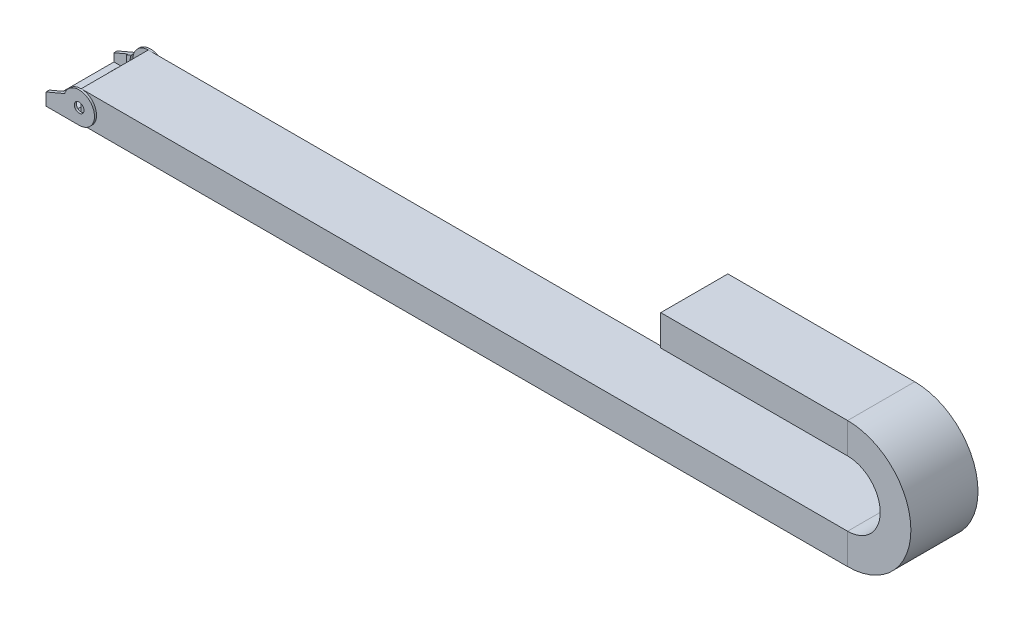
ISO-10303-21;
HEADER;
FILE_DESCRIPTION(('STEP AP214'),'2;1');
FILE_NAME('part.step','',(''),(''),'','','');
FILE_SCHEMA(('AUTOMOTIVE_DESIGN { 1 0 10303 214 1 1 1 1 }'));
ENDSEC;
DATA;
#1=APPLICATION_CONTEXT('core data for automotive mechanical design processes');
#2=APPLICATION_PROTOCOL_DEFINITION('international standard','automotive_design',2000,#1);
#3=PRODUCT_CONTEXT('',#1,'mechanical');
#4=PRODUCT('Part','Part','',(#3));
#5=PRODUCT_RELATED_PRODUCT_CATEGORY('part','',(#4));
#6=PRODUCT_DEFINITION_FORMATION('','',#4);
#7=PRODUCT_DEFINITION_CONTEXT('part definition',#1,'design');
#8=PRODUCT_DEFINITION('design','',#6,#7);
#9=PRODUCT_DEFINITION_SHAPE('','',#8);
#10=(LENGTH_UNIT() NAMED_UNIT(*) SI_UNIT(.MILLI.,.METRE.));
#11=(NAMED_UNIT(*) PLANE_ANGLE_UNIT() SI_UNIT($,.RADIAN.));
#12=(NAMED_UNIT(*) SI_UNIT($,.STERADIAN.) SOLID_ANGLE_UNIT());
#13=UNCERTAINTY_MEASURE_WITH_UNIT(LENGTH_MEASURE(1.E-05),#10,'distance_accuracy_value','');
#14=(GEOMETRIC_REPRESENTATION_CONTEXT(3) GLOBAL_UNCERTAINTY_ASSIGNED_CONTEXT((#13)) GLOBAL_UNIT_ASSIGNED_CONTEXT((#10,
#11,#12)) REPRESENTATION_CONTEXT('',''));
#15=CARTESIAN_POINT('',(0.,0.,0.));
#16=DIRECTION('',(0.,0.,1.));
#17=DIRECTION('',(1.,0.,0.));
#18=AXIS2_PLACEMENT_3D('',#15,#16,#17);
#19=CARTESIAN_POINT('',(0.,0.,54.737));
#20=DIRECTION('',(0.,0.,1.));
#21=DIRECTION('',(1.,0.,0.));
#22=AXIS2_PLACEMENT_3D('',#19,#20,#21);
#23=PLANE('',#22);
#24=DIRECTION('',(0.,-1.,0.));
#25=VECTOR('',#24,1.);
#26=CARTESIAN_POINT('',(-76.2,25.019,54.737));
#27=LINE('',#26,#25);
#28=CARTESIAN_POINT('',(-76.2,-7.874,54.737));
#29=VERTEX_POINT('',#28);
#30=CARTESIAN_POINT('',(-76.2,-25.019,54.737));
#31=VERTEX_POINT('',#30);
#32=EDGE_CURVE('E959',#29,#31,#27,.T.);
#33=ORIENTED_EDGE('',*,*,#32,.T.);
#34=DIRECTION('',(1.,0.,0.));
#35=VECTOR('',#34,1.);
#36=CARTESIAN_POINT('',(-86.6480176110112,-25.019,54.737));
#37=LINE('',#36,#35);
#38=CARTESIAN_POINT('',(-86.6480176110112,-25.019,54.737));
#39=VERTEX_POINT('',#38);
#40=EDGE_CURVE('E439',#39,#31,#37,.T.);
#41=ORIENTED_EDGE('',*,*,#40,.F.);
#42=DIRECTION('',(0.,-1.,0.));
#43=VECTOR('',#42,1.);
#44=CARTESIAN_POINT('',(-86.6480176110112,-22.733,54.737));
#45=LINE('',#44,#43);
#46=CARTESIAN_POINT('',(-86.6480176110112,-22.733,54.737));
#47=VERTEX_POINT('',#46);
#48=EDGE_CURVE('E443',#47,#39,#45,.T.);
#49=ORIENTED_EDGE('',*,*,#48,.F.);
#50=CARTESIAN_POINT('',(-76.2,0.,54.737));
#51=DIRECTION('',(0.,0.,1.));
#52=DIRECTION('',(1.,0.,0.));
#53=AXIS2_PLACEMENT_3D('',#50,#51,#52);
#54=CIRCLE('',#53,25.019);
#55=CARTESIAN_POINT('',(-99.9051547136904,8.001,54.737));
#56=VERTEX_POINT('',#55);
#57=EDGE_CURVE('E448',#56,#47,#54,.T.);
#58=ORIENTED_EDGE('',*,*,#57,.F.);
#59=CARTESIAN_POINT('',(-76.2,25.019,54.737));
#60=VERTEX_POINT('',#59);
#61=EDGE_CURVE('E51',#60,#56,#54,.T.);
#62=ORIENTED_EDGE('',*,*,#61,.F.);
#63=CARTESIAN_POINT('',(-76.2,7.874,54.737));
#64=VERTEX_POINT('',#63);
#65=EDGE_CURVE('E381',#60,#64,#27,.T.);
#66=ORIENTED_EDGE('',*,*,#65,.T.);
#67=CARTESIAN_POINT('',(-76.2,0.,54.737));
#68=DIRECTION('',(0.,0.,1.));
#69=DIRECTION('',(1.,0.,0.));
#70=AXIS2_PLACEMENT_3D('',#67,#68,#69);
#71=CIRCLE('',#70,7.874);
#72=EDGE_CURVE('E424',#64,#29,#71,.T.);
#73=ORIENTED_EDGE('',*,*,#72,.T.);
#74=EDGE_LOOP('',(#33,#41,#49,#58,#62,#66,#73));
#75=FACE_BOUND('',#74,.T.);
#76=ADVANCED_FACE('F35',(#75),#23,.F.);
#77=CARTESIAN_POINT('',(0.,0.,-54.737));
#78=DIRECTION('',(0.,0.,-1.));
#79=DIRECTION('',(1.,0.,0.));
#80=AXIS2_PLACEMENT_3D('',#77,#78,#79);
#81=PLANE('',#80);
#82=DIRECTION('',(0.,1.,0.));
#83=VECTOR('',#82,1.);
#84=CARTESIAN_POINT('',(-76.2,25.019,-54.737));
#85=LINE('',#84,#83);
#86=CARTESIAN_POINT('',(-76.2,7.874,-54.737));
#87=VERTEX_POINT('',#86);
#88=CARTESIAN_POINT('',(-76.2,25.019,-54.737));
#89=VERTEX_POINT('',#88);
#90=EDGE_CURVE('E59',#87,#89,#85,.T.);
#91=ORIENTED_EDGE('',*,*,#90,.T.);
#92=CARTESIAN_POINT('',(-76.2,0.,-54.737));
#93=DIRECTION('',(0.,0.,-1.));
#94=DIRECTION('',(-1.,0.,0.));
#95=AXIS2_PLACEMENT_3D('',#92,#93,#94);
#96=CIRCLE('',#95,25.019);
#97=CARTESIAN_POINT('',(-99.9051547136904,8.001,-54.737));
#98=VERTEX_POINT('',#97);
#99=EDGE_CURVE('E436',#89,#98,#96,.F.);
#100=ORIENTED_EDGE('',*,*,#99,.T.);
#101=CARTESIAN_POINT('',(-86.6480176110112,-22.733,-54.737));
#102=VERTEX_POINT('',#101);
#103=EDGE_CURVE('E437',#98,#102,#96,.F.);
#104=ORIENTED_EDGE('',*,*,#103,.T.);
#105=DIRECTION('',(0.,-1.,0.));
#106=VECTOR('',#105,1.);
#107=CARTESIAN_POINT('',(-86.6480176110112,-22.733,-54.737));
#108=LINE('',#107,#106);
#109=CARTESIAN_POINT('',(-86.6480176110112,-25.019,-54.737));
#110=VERTEX_POINT('',#109);
#111=EDGE_CURVE('E427',#102,#110,#108,.T.);
#112=ORIENTED_EDGE('',*,*,#111,.T.);
#113=DIRECTION('',(1.,0.,0.));
#114=VECTOR('',#113,1.);
#115=CARTESIAN_POINT('',(-86.6480176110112,-25.019,-54.737));
#116=LINE('',#115,#114);
#117=CARTESIAN_POINT('',(-76.2,-25.019,-54.737));
#118=VERTEX_POINT('',#117);
#119=EDGE_CURVE('E431',#110,#118,#116,.T.);
#120=ORIENTED_EDGE('',*,*,#119,.T.);
#121=CARTESIAN_POINT('',(-76.2,-7.874,-54.737));
#122=VERTEX_POINT('',#121);
#123=EDGE_CURVE('E360',#118,#122,#85,.T.);
#124=ORIENTED_EDGE('',*,*,#123,.T.);
#125=CARTESIAN_POINT('',(-76.2,0.,-54.737));
#126=DIRECTION('',(0.,0.,-1.));
#127=DIRECTION('',(-1.,0.,0.));
#128=AXIS2_PLACEMENT_3D('',#125,#126,#127);
#129=CIRCLE('',#128,7.874);
#130=EDGE_CURVE('E421',#122,#87,#129,.T.);
#131=ORIENTED_EDGE('',*,*,#130,.T.);
#132=EDGE_LOOP('',(#91,#100,#104,#112,#120,#124,#131));
#133=FACE_BOUND('',#132,.T.);
#134=ADVANCED_FACE('F734',(#133),#81,.F.);
#135=CARTESIAN_POINT('',(-107.188,-17.907,90.5088962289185));
#136=DIRECTION('',(0.,1.,0.));
#137=DIRECTION('',(0.,0.,1.));
#138=AXIS2_PLACEMENT_3D('',#135,#136,#137);
#139=PLANE('',#138);
#140=DIRECTION('',(0.,0.,-1.));
#141=VECTOR('',#140,1.);
#142=CARTESIAN_POINT('',(-107.188,-17.907,45.72));
#143=LINE('',#142,#141);
#144=CARTESIAN_POINT('',(-107.188,-17.907,45.72));
#145=VERTEX_POINT('',#144);
#146=CARTESIAN_POINT('',(-107.188,-17.907,34.29));
#147=VERTEX_POINT('',#146);
#148=EDGE_CURVE('E522',#145,#147,#143,.T.);
#149=ORIENTED_EDGE('',*,*,#148,.F.);
#150=CARTESIAN_POINT('',(-113.284,-17.907,45.72));
#151=DIRECTION('',(0.,-1.,0.));
#152=DIRECTION('',(0.,0.,1.));
#153=AXIS2_PLACEMENT_3D('',#150,#151,#152);
#154=CIRCLE('',#153,6.09600000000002);
#155=CARTESIAN_POINT('',(-119.38,-17.907,45.72));
#156=VERTEX_POINT('',#155);
#157=EDGE_CURVE('E531',#156,#145,#154,.F.);
#158=ORIENTED_EDGE('',*,*,#157,.F.);
#159=DIRECTION('',(0.,0.,1.));
#160=VECTOR('',#159,1.);
#161=CARTESIAN_POINT('',(-119.38,-17.907,34.29));
#162=LINE('',#161,#160);
#163=CARTESIAN_POINT('',(-119.38,-17.907,34.29));
#164=VERTEX_POINT('',#163);
#165=EDGE_CURVE('E536',#164,#156,#162,.T.);
#166=ORIENTED_EDGE('',*,*,#165,.F.);
#167=CARTESIAN_POINT('',(-113.284,-17.907,34.29));
#168=DIRECTION('',(0.,-1.,0.));
#169=DIRECTION('',(0.,0.,1.));
#170=AXIS2_PLACEMENT_3D('',#167,#168,#169);
#171=CIRCLE('',#170,6.09600000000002);
#172=EDGE_CURVE('E540',#147,#164,#171,.F.);
#173=ORIENTED_EDGE('',*,*,#172,.F.);
#174=EDGE_LOOP('',(#149,#158,#166,#173));
#175=FACE_BOUND('',#174,.T.);
#176=DIRECTION('',(0.,0.,-1.));
#177=VECTOR('',#176,1.);
#178=CARTESIAN_POINT('',(-107.188,-17.907,-45.72));
#179=LINE('',#178,#177);
#180=CARTESIAN_POINT('',(-107.188,-17.907,-45.72));
#181=VERTEX_POINT('',#180);
#182=CARTESIAN_POINT('',(-107.188,-17.907,-34.29));
#183=VERTEX_POINT('',#182);
#184=EDGE_CURVE('E480',#181,#183,#179,.F.);
#185=ORIENTED_EDGE('',*,*,#184,.T.);
#186=CARTESIAN_POINT('',(-113.284,-17.907,-34.29));
#187=DIRECTION('',(0.,-1.,0.));
#188=DIRECTION('',(0.,0.,1.));
#189=AXIS2_PLACEMENT_3D('',#186,#187,#188);
#190=CIRCLE('',#189,6.09600000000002);
#191=CARTESIAN_POINT('',(-119.38,-17.907,-34.29));
#192=VERTEX_POINT('',#191);
#193=EDGE_CURVE('E476',#183,#192,#190,.T.);
#194=ORIENTED_EDGE('',*,*,#193,.T.);
#195=DIRECTION('',(0.,0.,1.));
#196=VECTOR('',#195,1.);
#197=CARTESIAN_POINT('',(-119.38,-17.907,-34.29));
#198=LINE('',#197,#196);
#199=CARTESIAN_POINT('',(-119.38,-17.907,-45.72));
#200=VERTEX_POINT('',#199);
#201=EDGE_CURVE('E486',#192,#200,#198,.F.);
#202=ORIENTED_EDGE('',*,*,#201,.T.);
#203=CARTESIAN_POINT('',(-113.284,-17.907,-45.72));
#204=DIRECTION('',(0.,-1.,0.));
#205=DIRECTION('',(0.,0.,1.));
#206=AXIS2_PLACEMENT_3D('',#203,#204,#205);
#207=CIRCLE('',#206,6.09600000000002);
#208=EDGE_CURVE('E483',#200,#181,#207,.T.);
#209=ORIENTED_EDGE('',*,*,#208,.T.);
#210=EDGE_LOOP('',(#185,#194,#202,#209));
#211=FACE_BOUND('',#210,.T.);
#212=DIRECTION('',(-1.,0.,0.));
#213=VECTOR('',#212,1.);
#214=CARTESIAN_POINT('',(-90.424,-17.907,50.038));
#215=LINE('',#214,#213);
#216=CARTESIAN_POINT('',(-93.6725416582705,-17.907,50.038));
#217=VERTEX_POINT('',#216);
#218=CARTESIAN_POINT('',(-107.188,-17.907,50.038));
#219=VERTEX_POINT('',#218);
#220=EDGE_CURVE('E623',#217,#219,#215,.T.);
#221=ORIENTED_EDGE('',*,*,#220,.F.);
#222=DIRECTION('',(0.,0.,-1.));
#223=VECTOR('',#222,1.);
#224=CARTESIAN_POINT('',(-93.6725416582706,-17.907,125.501418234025));
#225=LINE('',#224,#223);
#226=CARTESIAN_POINT('',(-93.6725416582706,-17.907,-50.038));
#227=VERTEX_POINT('',#226);
#228=EDGE_CURVE('E442',#217,#227,#225,.T.);
#229=ORIENTED_EDGE('',*,*,#228,.T.);
#230=DIRECTION('',(-1.,0.,0.));
#231=VECTOR('',#230,1.);
#232=CARTESIAN_POINT('',(-90.424,-17.907,-50.038));
#233=LINE('',#232,#231);
#234=CARTESIAN_POINT('',(-107.188,-17.907,-50.038));
#235=VERTEX_POINT('',#234);
#236=EDGE_CURVE('E613',#227,#235,#233,.T.);
#237=ORIENTED_EDGE('',*,*,#236,.T.);
#238=DIRECTION('',(0.,0.,-1.));
#239=VECTOR('',#238,1.);
#240=CARTESIAN_POINT('',(-107.188,-17.907,90.5088962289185));
#241=LINE('',#240,#239);
#242=CARTESIAN_POINT('',(-107.188,-17.907,-52.705));
#243=VERTEX_POINT('',#242);
#244=EDGE_CURVE('E662',#235,#243,#241,.T.);
#245=ORIENTED_EDGE('',*,*,#244,.T.);
#246=DIRECTION('',(1.,0.,0.));
#247=VECTOR('',#246,1.);
#248=CARTESIAN_POINT('',(-107.188,-17.907,-52.705));
#249=LINE('',#248,#247);
#250=CARTESIAN_POINT('',(-130.302,-17.907,-52.705));
#251=VERTEX_POINT('',#250);
#252=EDGE_CURVE('E635',#251,#243,#249,.T.);
#253=ORIENTED_EDGE('',*,*,#252,.F.);
#254=DIRECTION('',(0.,0.,-1.));
#255=VECTOR('',#254,1.);
#256=CARTESIAN_POINT('',(-130.302,-17.907,90.5088962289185));
#257=LINE('',#256,#255);
#258=CARTESIAN_POINT('',(-130.302,-17.907,52.705));
#259=VERTEX_POINT('',#258);
#260=EDGE_CURVE('E658',#259,#251,#257,.T.);
#261=ORIENTED_EDGE('',*,*,#260,.F.);
#262=DIRECTION('',(-1.,0.,0.));
#263=VECTOR('',#262,1.);
#264=CARTESIAN_POINT('',(-107.188,-17.907,52.705));
#265=LINE('',#264,#263);
#266=CARTESIAN_POINT('',(-107.188,-17.907,52.705));
#267=VERTEX_POINT('',#266);
#268=EDGE_CURVE('E646',#267,#259,#265,.T.);
#269=ORIENTED_EDGE('',*,*,#268,.F.);
#270=EDGE_CURVE('E663',#267,#219,#241,.T.);
#271=ORIENTED_EDGE('',*,*,#270,.T.);
#272=EDGE_LOOP('',(#221,#229,#237,#245,#253,#261,#269,#271));
#273=FACE_BOUND('',#272,.T.);
#274=ADVANCED_FACE('F792',(#175,#211,#273),#139,.T.);
#275=CARTESIAN_POINT('',(-76.2,-25.019,58.039));
#276=DIRECTION('',(0.,1.,0.));
#277=DIRECTION('',(0.,0.,1.));
#278=AXIS2_PLACEMENT_3D('',#275,#276,#277);
#279=PLANE('',#278);
#280=DIRECTION('',(0.,0.,-1.));
#281=VECTOR('',#280,1.);
#282=CARTESIAN_POINT('',(-110.236,-25.019,45.72));
#283=LINE('',#282,#281);
#284=CARTESIAN_POINT('',(-110.236,-25.019,45.72));
#285=VERTEX_POINT('',#284);
#286=CARTESIAN_POINT('',(-110.236,-25.019,34.29));
#287=VERTEX_POINT('',#286);
#288=EDGE_CURVE('E564',#285,#287,#283,.T.);
#289=ORIENTED_EDGE('',*,*,#288,.T.);
#290=CARTESIAN_POINT('',(-113.284,-25.019,34.29));
#291=DIRECTION('',(0.,1.,0.));
#292=DIRECTION('',(0.,0.,-1.));
#293=AXIS2_PLACEMENT_3D('',#290,#291,#292);
#294=CIRCLE('',#293,3.04800000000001);
#295=CARTESIAN_POINT('',(-116.332,-25.019,34.29));
#296=VERTEX_POINT('',#295);
#297=EDGE_CURVE('E567',#287,#296,#294,.T.);
#298=ORIENTED_EDGE('',*,*,#297,.T.);
#299=DIRECTION('',(0.,0.,1.));
#300=VECTOR('',#299,1.);
#301=CARTESIAN_POINT('',(-116.332,-25.019,45.72));
#302=LINE('',#301,#300);
#303=CARTESIAN_POINT('',(-116.332,-25.019,45.72));
#304=VERTEX_POINT('',#303);
#305=EDGE_CURVE('E552',#296,#304,#302,.T.);
#306=ORIENTED_EDGE('',*,*,#305,.T.);
#307=CARTESIAN_POINT('',(-113.284,-25.019,45.72));
#308=DIRECTION('',(0.,1.,0.));
#309=DIRECTION('',(0.,0.,-1.));
#310=AXIS2_PLACEMENT_3D('',#307,#308,#309);
#311=CIRCLE('',#310,3.04800000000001);
#312=EDGE_CURVE('E547',#304,#285,#311,.T.);
#313=ORIENTED_EDGE('',*,*,#312,.T.);
#314=EDGE_LOOP('',(#289,#298,#306,#313));
#315=FACE_BOUND('',#314,.T.);
#316=CARTESIAN_POINT('',(-113.284,-25.019,-45.72));
#317=DIRECTION('',(0.,-1.,0.));
#318=DIRECTION('',(0.,0.,1.));
#319=AXIS2_PLACEMENT_3D('',#316,#317,#318);
#320=CIRCLE('',#319,3.04800000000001);
#321=CARTESIAN_POINT('',(-116.332,-25.019,-45.72));
#322=VERTEX_POINT('',#321);
#323=CARTESIAN_POINT('',(-110.236,-25.019,-45.72));
#324=VERTEX_POINT('',#323);
#325=EDGE_CURVE('E479',#322,#324,#320,.T.);
#326=ORIENTED_EDGE('',*,*,#325,.F.);
#327=DIRECTION('',(0.,0.,-1.));
#328=VECTOR('',#327,1.);
#329=CARTESIAN_POINT('',(-116.332,-25.019,-45.72));
#330=LINE('',#329,#328);
#331=CARTESIAN_POINT('',(-116.332,-25.019,-34.29));
#332=VERTEX_POINT('',#331);
#333=EDGE_CURVE('E512',#332,#322,#330,.T.);
#334=ORIENTED_EDGE('',*,*,#333,.F.);
#335=CARTESIAN_POINT('',(-113.284,-25.019,-34.29));
#336=DIRECTION('',(0.,-1.,0.));
#337=DIRECTION('',(0.,0.,1.));
#338=AXIS2_PLACEMENT_3D('',#335,#336,#337);
#339=CIRCLE('',#338,3.04800000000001);
#340=CARTESIAN_POINT('',(-110.236,-25.019,-34.29));
#341=VERTEX_POINT('',#340);
#342=EDGE_CURVE('E515',#341,#332,#339,.T.);
#343=ORIENTED_EDGE('',*,*,#342,.F.);
#344=DIRECTION('',(0.,0.,1.));
#345=VECTOR('',#344,1.);
#346=CARTESIAN_POINT('',(-110.236,-25.019,-45.72));
#347=LINE('',#346,#345);
#348=EDGE_CURVE('E500',#324,#341,#347,.T.);
#349=ORIENTED_EDGE('',*,*,#348,.F.);
#350=EDGE_LOOP('',(#326,#334,#343,#349));
#351=FACE_BOUND('',#350,.T.);
#352=DIRECTION('',(0.,0.,-1.));
#353=VECTOR('',#352,1.);
#354=CARTESIAN_POINT('',(-86.6480176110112,-25.019,125.501418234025));
#355=LINE('',#354,#353);
#356=CARTESIAN_POINT('',(-86.6480176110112,-25.019,50.038));
#357=VERTEX_POINT('',#356);
#358=EDGE_CURVE('E453',#39,#357,#355,.T.);
#359=ORIENTED_EDGE('',*,*,#358,.F.);
#360=ORIENTED_EDGE('',*,*,#40,.T.);
#361=DIRECTION('',(0.,0.,-1.));
#362=VECTOR('',#361,1.);
#363=CARTESIAN_POINT('',(-76.2,-25.019,58.039));
#364=LINE('',#363,#362);
#365=CARTESIAN_POINT('',(-76.2,-25.019,58.039));
#366=VERTEX_POINT('',#365);
#367=EDGE_CURVE('E699',#366,#31,#364,.T.);
#368=ORIENTED_EDGE('',*,*,#367,.F.);
#369=DIRECTION('',(-1.,0.,0.));
#370=VECTOR('',#369,1.);
#371=CARTESIAN_POINT('',(-76.2,-25.019,58.039));
#372=LINE('',#371,#370);
#373=CARTESIAN_POINT('',(-130.302,-25.019,58.039));
#374=VERTEX_POINT('',#373);
#375=EDGE_CURVE('E668',#366,#374,#372,.T.);
#376=ORIENTED_EDGE('',*,*,#375,.T.);
#377=DIRECTION('',(0.,0.,-1.));
#378=VECTOR('',#377,1.);
#379=CARTESIAN_POINT('',(-130.302,-25.019,58.039));
#380=LINE('',#379,#378);
#381=CARTESIAN_POINT('',(-130.302,-25.019,52.705));
#382=VERTEX_POINT('',#381);
#383=EDGE_CURVE('E695',#374,#382,#380,.T.);
#384=ORIENTED_EDGE('',*,*,#383,.T.);
#385=DIRECTION('',(1.,0.,0.));
#386=VECTOR('',#385,1.);
#387=CARTESIAN_POINT('',(-120.396,-25.019,52.705));
#388=LINE('',#387,#386);
#389=CARTESIAN_POINT('',(-120.396,-25.019,52.705));
#390=VERTEX_POINT('',#389);
#391=EDGE_CURVE('E584',#382,#390,#388,.T.);
#392=ORIENTED_EDGE('',*,*,#391,.T.);
#393=DIRECTION('',(0.,0.,-1.));
#394=VECTOR('',#393,1.);
#395=CARTESIAN_POINT('',(-120.396,-25.019,-52.705));
#396=LINE('',#395,#394);
#397=CARTESIAN_POINT('',(-120.396,-25.019,-52.705));
#398=VERTEX_POINT('',#397);
#399=EDGE_CURVE('E574',#390,#398,#396,.T.);
#400=ORIENTED_EDGE('',*,*,#399,.T.);
#401=DIRECTION('',(-1.,0.,0.));
#402=VECTOR('',#401,1.);
#403=CARTESIAN_POINT('',(-120.396,-25.019,-52.705));
#404=LINE('',#403,#402);
#405=CARTESIAN_POINT('',(-130.302,-25.019,-52.705));
#406=VERTEX_POINT('',#405);
#407=EDGE_CURVE('E594',#398,#406,#404,.T.);
#408=ORIENTED_EDGE('',*,*,#407,.T.);
#409=CARTESIAN_POINT('',(-130.302,-25.019,-58.039));
#410=VERTEX_POINT('',#409);
#411=EDGE_CURVE('E694',#406,#410,#380,.T.);
#412=ORIENTED_EDGE('',*,*,#411,.T.);
#413=DIRECTION('',(-1.,0.,0.));
#414=VECTOR('',#413,1.);
#415=CARTESIAN_POINT('',(-76.2,-25.019,-58.039));
#416=LINE('',#415,#414);
#417=CARTESIAN_POINT('',(-76.2,-25.019,-58.039));
#418=VERTEX_POINT('',#417);
#419=EDGE_CURVE('E649',#418,#410,#416,.T.);
#420=ORIENTED_EDGE('',*,*,#419,.F.);
#421=EDGE_CURVE('E698',#118,#418,#364,.T.);
#422=ORIENTED_EDGE('',*,*,#421,.F.);
#423=ORIENTED_EDGE('',*,*,#119,.F.);
#424=CARTESIAN_POINT('',(-86.6480176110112,-25.019,-50.038));
#425=VERTEX_POINT('',#424);
#426=EDGE_CURVE('E452',#425,#110,#355,.T.);
#427=ORIENTED_EDGE('',*,*,#426,.F.);
#428=DIRECTION('',(-1.,0.,0.));
#429=VECTOR('',#428,1.);
#430=CARTESIAN_POINT('',(-76.2,-25.019,-50.038));
#431=LINE('',#430,#429);
#432=CARTESIAN_POINT('',(-90.424,-25.019,-50.038));
#433=VERTEX_POINT('',#432);
#434=EDGE_CURVE('E607',#425,#433,#431,.T.);
#435=ORIENTED_EDGE('',*,*,#434,.T.);
#436=DIRECTION('',(0.,0.,1.));
#437=VECTOR('',#436,1.);
#438=CARTESIAN_POINT('',(-90.424,-25.019,-50.038));
#439=LINE('',#438,#437);
#440=CARTESIAN_POINT('',(-90.424,-25.019,50.038));
#441=VERTEX_POINT('',#440);
#442=EDGE_CURVE('E618',#433,#441,#439,.T.);
#443=ORIENTED_EDGE('',*,*,#442,.T.);
#444=DIRECTION('',(-1.,0.,0.));
#445=VECTOR('',#444,1.);
#446=CARTESIAN_POINT('',(-76.2,-25.019,50.038));
#447=LINE('',#446,#445);
#448=EDGE_CURVE('E601',#357,#441,#447,.T.);
#449=ORIENTED_EDGE('',*,*,#448,.F.);
#450=EDGE_LOOP('',(#359,#360,#368,#376,#384,#392,#400,#408,#412,#420,#422,#423,#427,#435,#443,#449));
#451=FACE_BOUND('',#450,.T.);
#452=ADVANCED_FACE('F722',(#315,#351,#451),#279,.F.);
#453=CARTESIAN_POINT('',(-90.424,-25.019,-50.038));
#454=DIRECTION('',(-1.,0.,0.));
#455=DIRECTION('',(0.,0.,-1.));
#456=AXIS2_PLACEMENT_3D('',#453,#454,#455);
#457=PLANE('',#456);
#458=DIRECTION('',(0.,0.,-1.));
#459=VECTOR('',#458,1.);
#460=CARTESIAN_POINT('',(-90.424,-20.5822298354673,125.501418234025));
#461=LINE('',#460,#459);
#462=CARTESIAN_POINT('',(-90.424,-20.5822298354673,50.038));
#463=VERTEX_POINT('',#462);
#464=CARTESIAN_POINT('',(-90.424,-20.5822298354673,-50.038));
#465=VERTEX_POINT('',#464);
#466=EDGE_CURVE('E460',#463,#465,#461,.T.);
#467=ORIENTED_EDGE('',*,*,#466,.F.);
#468=DIRECTION('',(0.,1.,0.));
#469=VECTOR('',#468,1.);
#470=CARTESIAN_POINT('',(-90.424,-25.019,50.038));
#471=LINE('',#470,#469);
#472=EDGE_CURVE('E620',#441,#463,#471,.T.);
#473=ORIENTED_EDGE('',*,*,#472,.F.);
#474=ORIENTED_EDGE('',*,*,#442,.F.);
#475=DIRECTION('',(0.,1.,0.));
#476=VECTOR('',#475,1.);
#477=CARTESIAN_POINT('',(-90.424,-25.019,-50.038));
#478=LINE('',#477,#476);
#479=EDGE_CURVE('E609',#433,#465,#478,.T.);
#480=ORIENTED_EDGE('',*,*,#479,.T.);
#481=EDGE_LOOP('',(#467,#473,#474,#480));
#482=FACE_BOUND('',#481,.T.);
#483=ADVANCED_FACE('F715',(#482),#457,.F.);
#484=CARTESIAN_POINT('',(-76.2,0.,-50.038));
#485=DIRECTION('',(0.,0.,1.));
#486=DIRECTION('',(-1.,0.,0.));
#487=AXIS2_PLACEMENT_3D('',#484,#485,#486);
#488=PLANE('',#487);
#489=ORIENTED_EDGE('',*,*,#434,.F.);
#490=DIRECTION('',(0.,1.,0.));
#491=VECTOR('',#490,1.);
#492=CARTESIAN_POINT('',(-86.6480176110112,0.,-50.038));
#493=LINE('',#492,#491);
#494=CARTESIAN_POINT('',(-86.6480176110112,-22.733,-50.038));
#495=VERTEX_POINT('',#494);
#496=EDGE_CURVE('E466',#425,#495,#493,.T.);
#497=ORIENTED_EDGE('',*,*,#496,.T.);
#498=CARTESIAN_POINT('',(-76.2,0.,-50.038));
#499=DIRECTION('',(0.,0.,1.));
#500=DIRECTION('',(1.,0.,0.));
#501=AXIS2_PLACEMENT_3D('',#498,#499,#500);
#502=CIRCLE('',#501,25.019);
#503=EDGE_CURVE('E461',#495,#465,#502,.F.);
#504=ORIENTED_EDGE('',*,*,#503,.T.);
#505=ORIENTED_EDGE('',*,*,#479,.F.);
#506=EDGE_LOOP('',(#489,#497,#504,#505));
#507=FACE_BOUND('',#506,.T.);
#508=ADVANCED_FACE('F727',(#507),#488,.T.);
#509=ORIENTED_EDGE('',*,*,#236,.F.);
#510=CARTESIAN_POINT('',(-99.9051547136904,8.001,-50.038));
#511=VERTEX_POINT('',#510);
#512=EDGE_CURVE('E457',#227,#511,#502,.F.);
#513=ORIENTED_EDGE('',*,*,#512,.T.);
#514=DIRECTION('',(0.919945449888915,0.392046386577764,0.));
#515=VECTOR('',#514,1.);
#516=CARTESIAN_POINT('',(-130.302,-4.953,-50.038));
#517=LINE('',#516,#515);
#518=CARTESIAN_POINT('',(-107.188,4.89732338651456,-50.038));
#519=VERTEX_POINT('',#518);
#520=EDGE_CURVE('E615',#519,#511,#517,.T.);
#521=ORIENTED_EDGE('',*,*,#520,.F.);
#522=DIRECTION('',(0.,-1.,0.));
#523=VECTOR('',#522,1.);
#524=CARTESIAN_POINT('',(-107.188,4.89732338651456,-50.038));
#525=LINE('',#524,#523);
#526=EDGE_CURVE('E632',#519,#235,#525,.T.);
#527=ORIENTED_EDGE('',*,*,#526,.T.);
#528=EDGE_LOOP('',(#509,#513,#521,#527));
#529=FACE_BOUND('',#528,.T.);
#530=ADVANCED_FACE('F881',(#529),#488,.T.);
#531=CARTESIAN_POINT('',(-76.2,0.,50.038));
#532=DIRECTION('',(0.,0.,1.));
#533=DIRECTION('',(-1.,0.,0.));
#534=AXIS2_PLACEMENT_3D('',#531,#532,#533);
#535=PLANE('',#534);
#536=DIRECTION('',(0.,1.,0.));
#537=VECTOR('',#536,1.);
#538=CARTESIAN_POINT('',(-86.6480176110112,0.,50.038));
#539=LINE('',#538,#537);
#540=CARTESIAN_POINT('',(-86.6480176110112,-22.733,50.038));
#541=VERTEX_POINT('',#540);
#542=EDGE_CURVE('E12',#357,#541,#539,.T.);
#543=ORIENTED_EDGE('',*,*,#542,.F.);
#544=ORIENTED_EDGE('',*,*,#448,.T.);
#545=ORIENTED_EDGE('',*,*,#472,.T.);
#546=CARTESIAN_POINT('',(-76.2,0.,50.038));
#547=DIRECTION('',(0.,0.,1.));
#548=DIRECTION('',(1.,0.,0.));
#549=AXIS2_PLACEMENT_3D('',#546,#547,#548);
#550=CIRCLE('',#549,25.019);
#551=EDGE_CURVE('E44',#541,#463,#550,.F.);
#552=ORIENTED_EDGE('',*,*,#551,.F.);
#553=EDGE_LOOP('',(#543,#544,#545,#552));
#554=FACE_BOUND('',#553,.T.);
#555=ADVANCED_FACE('F718',(#554),#535,.F.);
#556=CARTESIAN_POINT('',(-99.9051547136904,8.001,50.038));
#557=VERTEX_POINT('',#556);
#558=EDGE_CURVE('E702',#217,#557,#550,.F.);
#559=ORIENTED_EDGE('',*,*,#558,.F.);
#560=ORIENTED_EDGE('',*,*,#220,.T.);
#561=DIRECTION('',(0.,-1.,0.));
#562=VECTOR('',#561,1.);
#563=CARTESIAN_POINT('',(-107.188,4.89732338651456,50.038));
#564=LINE('',#563,#562);
#565=CARTESIAN_POINT('',(-107.188,4.89732338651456,50.038));
#566=VERTEX_POINT('',#565);
#567=EDGE_CURVE('E629',#566,#219,#564,.T.);
#568=ORIENTED_EDGE('',*,*,#567,.F.);
#569=DIRECTION('',(0.919945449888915,0.392046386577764,0.));
#570=VECTOR('',#569,1.);
#571=CARTESIAN_POINT('',(-130.302,-4.953,50.038));
#572=LINE('',#571,#570);
#573=EDGE_CURVE('E610',#566,#557,#572,.T.);
#574=ORIENTED_EDGE('',*,*,#573,.T.);
#575=EDGE_LOOP('',(#559,#560,#568,#574));
#576=FACE_BOUND('',#575,.T.);
#577=ADVANCED_FACE('F884',(#576),#535,.F.);
#578=CARTESIAN_POINT('',(-76.2,0.,58.039));
#579=DIRECTION('',(0.,0.,-1.));
#580=DIRECTION('',(1.,0.,0.));
#581=AXIS2_PLACEMENT_3D('',#578,#579,#580);
#582=CYLINDRICAL_SURFACE('',#581,25.019);
#583=DIRECTION('',(0.,0.,-1.));
#584=VECTOR('',#583,1.);
#585=CARTESIAN_POINT('',(-99.9051547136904,8.001,58.039));
#586=LINE('',#585,#584);
#587=CARTESIAN_POINT('',(-99.9051547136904,8.001,-58.039));
#588=VERTEX_POINT('',#587);
#589=EDGE_CURVE('E678',#98,#588,#586,.T.);
#590=ORIENTED_EDGE('',*,*,#589,.F.);
#591=ORIENTED_EDGE('',*,*,#99,.F.);
#592=EDGE_CURVE('E432',#118,#89,#96,.F.);
#593=ORIENTED_EDGE('',*,*,#592,.F.);
#594=ORIENTED_EDGE('',*,*,#421,.T.);
#595=CARTESIAN_POINT('',(-76.2,0.,-58.039));
#596=DIRECTION('',(0.,0.,1.));
#597=DIRECTION('',(1.,0.,0.));
#598=AXIS2_PLACEMENT_3D('',#595,#596,#597);
#599=CIRCLE('',#598,25.019);
#600=EDGE_CURVE('E469',#418,#588,#599,.T.);
#601=ORIENTED_EDGE('',*,*,#600,.T.);
#602=EDGE_LOOP('',(#590,#591,#593,#594,#601));
#603=FACE_BOUND('',#602,.T.);
#604=ADVANCED_FACE('F975',(#603),#582,.T.);
#605=ORIENTED_EDGE('',*,*,#367,.T.);
#606=EDGE_CURVE('E446',#31,#60,#54,.T.);
#607=ORIENTED_EDGE('',*,*,#606,.T.);
#608=ORIENTED_EDGE('',*,*,#61,.T.);
#609=CARTESIAN_POINT('',(-99.9051547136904,8.001,58.039));
#610=VERTEX_POINT('',#609);
#611=EDGE_CURVE('E686',#610,#56,#586,.T.);
#612=ORIENTED_EDGE('',*,*,#611,.F.);
#613=CARTESIAN_POINT('',(-76.2,0.,58.039));
#614=DIRECTION('',(0.,0.,1.));
#615=DIRECTION('',(1.,0.,0.));
#616=AXIS2_PLACEMENT_3D('',#613,#614,#615);
#617=CIRCLE('',#616,25.019);
#618=EDGE_CURVE('E472',#366,#610,#617,.T.);
#619=ORIENTED_EDGE('',*,*,#618,.F.);
#620=EDGE_LOOP('',(#605,#607,#608,#612,#619));
#621=FACE_BOUND('',#620,.T.);
#622=ADVANCED_FACE('F37',(#621),#582,.T.);
#623=CARTESIAN_POINT('',(-130.302,-4.953,58.039));
#624=DIRECTION('',(0.392046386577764,-0.919945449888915,0.));
#625=DIRECTION('',(-0.919945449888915,-0.392046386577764,0.));
#626=AXIS2_PLACEMENT_3D('',#623,#624,#625);
#627=PLANE('',#626);
#628=ORIENTED_EDGE('',*,*,#520,.T.);
#629=EDGE_CURVE('E690',#511,#98,#586,.T.);
#630=ORIENTED_EDGE('',*,*,#629,.T.);
#631=ORIENTED_EDGE('',*,*,#589,.T.);
#632=DIRECTION('',(0.919945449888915,0.392046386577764,0.));
#633=VECTOR('',#632,1.);
#634=CARTESIAN_POINT('',(-130.302,-4.953,-58.039));
#635=LINE('',#634,#633);
#636=CARTESIAN_POINT('',(-130.302,-4.953,-58.039));
#637=VERTEX_POINT('',#636);
#638=EDGE_CURVE('E672',#637,#588,#635,.T.);
#639=ORIENTED_EDGE('',*,*,#638,.F.);
#640=DIRECTION('',(0.,0.,-1.));
#641=VECTOR('',#640,1.);
#642=CARTESIAN_POINT('',(-130.302,-4.953,58.039));
#643=LINE('',#642,#641);
#644=CARTESIAN_POINT('',(-130.302,-4.953,-52.705));
#645=VERTEX_POINT('',#644);
#646=EDGE_CURVE('E689',#645,#637,#643,.T.);
#647=ORIENTED_EDGE('',*,*,#646,.F.);
#648=DIRECTION('',(-0.919945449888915,-0.392046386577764,0.));
#649=VECTOR('',#648,1.);
#650=CARTESIAN_POINT('',(-130.302,-4.953,-52.705));
#651=LINE('',#650,#649);
#652=CARTESIAN_POINT('',(-107.188,4.89732338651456,-52.705));
#653=VERTEX_POINT('',#652);
#654=EDGE_CURVE('E640',#653,#645,#651,.T.);
#655=ORIENTED_EDGE('',*,*,#654,.F.);
#656=DIRECTION('',(0.,0.,-1.));
#657=VECTOR('',#656,1.);
#658=CARTESIAN_POINT('',(-107.188,4.89732338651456,90.5088962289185));
#659=LINE('',#658,#657);
#660=EDGE_CURVE('E645',#519,#653,#659,.T.);
#661=ORIENTED_EDGE('',*,*,#660,.F.);
#662=EDGE_LOOP('',(#628,#630,#631,#639,#647,#655,#661));
#663=FACE_BOUND('',#662,.T.);
#664=ADVANCED_FACE('F915',(#663),#627,.F.);
#665=CARTESIAN_POINT('',(-107.188,4.89732338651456,90.5088962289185));
#666=DIRECTION('',(-1.,0.,0.));
#667=DIRECTION('',(0.,1.,0.));
#668=AXIS2_PLACEMENT_3D('',#665,#666,#667);
#669=PLANE('',#668);
#670=ORIENTED_EDGE('',*,*,#660,.T.);
#671=DIRECTION('',(0.,1.,0.));
#672=VECTOR('',#671,1.);
#673=CARTESIAN_POINT('',(-107.188,4.89732338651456,-52.705));
#674=LINE('',#673,#672);
#675=EDGE_CURVE('E643',#243,#653,#674,.T.);
#676=ORIENTED_EDGE('',*,*,#675,.F.);
#677=ORIENTED_EDGE('',*,*,#244,.F.);
#678=ORIENTED_EDGE('',*,*,#526,.F.);
#679=EDGE_LOOP('',(#670,#676,#677,#678));
#680=FACE_BOUND('',#679,.T.);
#681=ADVANCED_FACE('F899',(#680),#669,.T.);
#682=CARTESIAN_POINT('',(-130.302,-25.019,58.039));
#683=DIRECTION('',(1.,0.,0.));
#684=DIRECTION('',(0.,0.,1.));
#685=AXIS2_PLACEMENT_3D('',#682,#683,#684);
#686=PLANE('',#685);
#687=ORIENTED_EDGE('',*,*,#383,.F.);
#688=DIRECTION('',(0.,1.,0.));
#689=VECTOR('',#688,1.);
#690=CARTESIAN_POINT('',(-130.302,-25.019,58.039));
#691=LINE('',#690,#689);
#692=CARTESIAN_POINT('',(-130.302,-4.953,58.039));
#693=VERTEX_POINT('',#692);
#694=EDGE_CURVE('E671',#374,#693,#691,.T.);
#695=ORIENTED_EDGE('',*,*,#694,.T.);
#696=CARTESIAN_POINT('',(-130.302,-4.953,52.705));
#697=VERTEX_POINT('',#696);
#698=EDGE_CURVE('E691',#693,#697,#643,.T.);
#699=ORIENTED_EDGE('',*,*,#698,.T.);
#700=DIRECTION('',(0.,1.,0.));
#701=VECTOR('',#700,1.);
#702=CARTESIAN_POINT('',(-130.302,-17.907,52.705));
#703=LINE('',#702,#701);
#704=EDGE_CURVE('E655',#259,#697,#703,.T.);
#705=ORIENTED_EDGE('',*,*,#704,.F.);
#706=ORIENTED_EDGE('',*,*,#260,.T.);
#707=DIRECTION('',(0.,-1.,0.));
#708=VECTOR('',#707,1.);
#709=CARTESIAN_POINT('',(-130.302,-17.907,-52.705));
#710=LINE('',#709,#708);
#711=EDGE_CURVE('E638',#645,#251,#710,.T.);
#712=ORIENTED_EDGE('',*,*,#711,.F.);
#713=ORIENTED_EDGE('',*,*,#646,.T.);
#714=DIRECTION('',(0.,1.,0.));
#715=VECTOR('',#714,1.);
#716=CARTESIAN_POINT('',(-130.302,-25.019,-58.039));
#717=LINE('',#716,#715);
#718=EDGE_CURVE('E681',#410,#637,#717,.T.);
#719=ORIENTED_EDGE('',*,*,#718,.F.);
#720=ORIENTED_EDGE('',*,*,#411,.F.);
#721=DIRECTION('',(0.,-1.,0.));
#722=VECTOR('',#721,1.);
#723=CARTESIAN_POINT('',(-130.302,-22.987,-52.705));
#724=LINE('',#723,#722);
#725=CARTESIAN_POINT('',(-130.302,-22.987,-52.705));
#726=VERTEX_POINT('',#725);
#727=EDGE_CURVE('E604',#726,#406,#724,.T.);
#728=ORIENTED_EDGE('',*,*,#727,.F.);
#729=DIRECTION('',(0.,0.,1.));
#730=VECTOR('',#729,1.);
#731=CARTESIAN_POINT('',(-130.302,-22.987,-52.705));
#732=LINE('',#731,#730);
#733=CARTESIAN_POINT('',(-130.302,-22.987,52.705));
#734=VERTEX_POINT('',#733);
#735=EDGE_CURVE('E586',#726,#734,#732,.T.);
#736=ORIENTED_EDGE('',*,*,#735,.T.);
#737=DIRECTION('',(0.,-1.,0.));
#738=VECTOR('',#737,1.);
#739=CARTESIAN_POINT('',(-130.302,-22.987,52.705));
#740=LINE('',#739,#738);
#741=EDGE_CURVE('E602',#734,#382,#740,.T.);
#742=ORIENTED_EDGE('',*,*,#741,.T.);
#743=EDGE_LOOP('',(#687,#695,#699,#705,#706,#712,#713,#719,#720,#728,#736,#742));
#744=FACE_BOUND('',#743,.T.);
#745=ADVANCED_FACE('F913',(#744),#686,.F.);
#746=CARTESIAN_POINT('',(-107.188,4.89732338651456,52.705));
#747=VERTEX_POINT('',#746);
#748=EDGE_CURVE('E659',#747,#566,#659,.T.);
#749=ORIENTED_EDGE('',*,*,#748,.F.);
#750=DIRECTION('',(0.919945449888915,0.392046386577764,0.));
#751=VECTOR('',#750,1.);
#752=CARTESIAN_POINT('',(-130.302,-4.953,52.705));
#753=LINE('',#752,#751);
#754=EDGE_CURVE('E652',#697,#747,#753,.T.);
#755=ORIENTED_EDGE('',*,*,#754,.F.);
#756=ORIENTED_EDGE('',*,*,#698,.F.);
#757=DIRECTION('',(0.919945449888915,0.392046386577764,0.));
#758=VECTOR('',#757,1.);
#759=CARTESIAN_POINT('',(-130.302,-4.953,58.039));
#760=LINE('',#759,#758);
#761=EDGE_CURVE('E675',#693,#610,#760,.T.);
#762=ORIENTED_EDGE('',*,*,#761,.T.);
#763=ORIENTED_EDGE('',*,*,#611,.T.);
#764=DIRECTION('',(0.,0.,-1.));
#765=VECTOR('',#764,1.);
#766=CARTESIAN_POINT('',(-99.9051547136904,8.001,125.501418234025));
#767=LINE('',#766,#765);
#768=EDGE_CURVE('E463',#557,#56,#767,.F.);
#769=ORIENTED_EDGE('',*,*,#768,.F.);
#770=ORIENTED_EDGE('',*,*,#573,.F.);
#771=EDGE_LOOP('',(#749,#755,#756,#762,#763,#769,#770));
#772=FACE_BOUND('',#771,.T.);
#773=ADVANCED_FACE('F905',(#772),#627,.F.);
#774=CARTESIAN_POINT('',(-76.2,0.,58.039));
#775=DIRECTION('',(0.,0.,1.));
#776=DIRECTION('',(-1.,0.,0.));
#777=AXIS2_PLACEMENT_3D('',#774,#775,#776);
#778=PLANE('',#777);
#779=CARTESIAN_POINT('',(-76.2,0.,58.039));
#780=DIRECTION('',(0.,0.,1.));
#781=DIRECTION('',(1.,0.,0.));
#782=AXIS2_PLACEMENT_3D('',#779,#780,#781);
#783=CIRCLE('',#782,7.874);
#784=CARTESIAN_POINT('',(-68.326,0.,58.039));
#785=VERTEX_POINT('',#784);
#786=EDGE_CURVE('E417',#785,#785,#783,.T.);
#787=ORIENTED_EDGE('',*,*,#786,.F.);
#788=EDGE_LOOP('',(#787));
#789=FACE_BOUND('',#788,.T.);
#790=ORIENTED_EDGE('',*,*,#618,.T.);
#791=ORIENTED_EDGE('',*,*,#761,.F.);
#792=ORIENTED_EDGE('',*,*,#694,.F.);
#793=ORIENTED_EDGE('',*,*,#375,.F.);
#794=EDGE_LOOP('',(#790,#791,#792,#793));
#795=FACE_BOUND('',#794,.T.);
#796=ADVANCED_FACE('F897',(#789,#795),#778,.T.);
#797=ORIENTED_EDGE('',*,*,#567,.T.);
#798=ORIENTED_EDGE('',*,*,#270,.F.);
#799=DIRECTION('',(0.,-1.,0.));
#800=VECTOR('',#799,1.);
#801=CARTESIAN_POINT('',(-107.188,4.89732338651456,52.705));
#802=LINE('',#801,#800);
#803=EDGE_CURVE('E650',#747,#267,#802,.T.);
#804=ORIENTED_EDGE('',*,*,#803,.F.);
#805=ORIENTED_EDGE('',*,*,#748,.T.);
#806=EDGE_LOOP('',(#797,#798,#804,#805));
#807=FACE_BOUND('',#806,.T.);
#808=ADVANCED_FACE('F894',(#807),#669,.T.);
#809=CARTESIAN_POINT('',(-76.2,0.,52.705));
#810=DIRECTION('',(0.,0.,1.));
#811=DIRECTION('',(-1.,0.,0.));
#812=AXIS2_PLACEMENT_3D('',#809,#810,#811);
#813=PLANE('',#812);
#814=ORIENTED_EDGE('',*,*,#704,.T.);
#815=ORIENTED_EDGE('',*,*,#754,.T.);
#816=ORIENTED_EDGE('',*,*,#803,.T.);
#817=ORIENTED_EDGE('',*,*,#268,.T.);
#818=EDGE_LOOP('',(#814,#815,#816,#817));
#819=FACE_BOUND('',#818,.T.);
#820=ADVANCED_FACE('F889',(#819),#813,.F.);
#821=CARTESIAN_POINT('',(-76.2,0.,-52.705));
#822=DIRECTION('',(0.,0.,1.));
#823=DIRECTION('',(-1.,0.,0.));
#824=AXIS2_PLACEMENT_3D('',#821,#822,#823);
#825=PLANE('',#824);
#826=ORIENTED_EDGE('',*,*,#654,.T.);
#827=ORIENTED_EDGE('',*,*,#711,.T.);
#828=ORIENTED_EDGE('',*,*,#252,.T.);
#829=ORIENTED_EDGE('',*,*,#675,.T.);
#830=EDGE_LOOP('',(#826,#827,#828,#829));
#831=FACE_BOUND('',#830,.T.);
#832=ADVANCED_FACE('F877',(#831),#825,.T.);
#833=CARTESIAN_POINT('',(-120.396,-22.987,-52.705));
#834=DIRECTION('',(1.,0.,0.));
#835=DIRECTION('',(0.,0.,1.));
#836=AXIS2_PLACEMENT_3D('',#833,#834,#835);
#837=PLANE('',#836);
#838=ORIENTED_EDGE('',*,*,#399,.F.);
#839=DIRECTION('',(0.,-1.,0.));
#840=VECTOR('',#839,1.);
#841=CARTESIAN_POINT('',(-120.396,-22.987,52.705));
#842=LINE('',#841,#840);
#843=CARTESIAN_POINT('',(-120.396,-22.987,52.705));
#844=VERTEX_POINT('',#843);
#845=EDGE_CURVE('E599',#844,#390,#842,.T.);
#846=ORIENTED_EDGE('',*,*,#845,.F.);
#847=DIRECTION('',(0.,0.,-1.));
#848=VECTOR('',#847,1.);
#849=CARTESIAN_POINT('',(-120.396,-22.987,-52.705));
#850=LINE('',#849,#848);
#851=CARTESIAN_POINT('',(-120.396,-22.987,-52.705));
#852=VERTEX_POINT('',#851);
#853=EDGE_CURVE('E580',#844,#852,#850,.T.);
#854=ORIENTED_EDGE('',*,*,#853,.T.);
#855=DIRECTION('',(0.,-1.,0.));
#856=VECTOR('',#855,1.);
#857=CARTESIAN_POINT('',(-120.396,-22.987,-52.705));
#858=LINE('',#857,#856);
#859=EDGE_CURVE('E591',#852,#398,#858,.T.);
#860=ORIENTED_EDGE('',*,*,#859,.T.);
#861=EDGE_LOOP('',(#838,#846,#854,#860));
#862=FACE_BOUND('',#861,.T.);
#863=ADVANCED_FACE('F870',(#862),#837,.F.);
#864=CARTESIAN_POINT('',(-120.396,-22.987,52.705));
#865=DIRECTION('',(0.,0.,1.));
#866=DIRECTION('',(-1.,0.,0.));
#867=AXIS2_PLACEMENT_3D('',#864,#865,#866);
#868=PLANE('',#867);
#869=ORIENTED_EDGE('',*,*,#391,.F.);
#870=ORIENTED_EDGE('',*,*,#741,.F.);
#871=DIRECTION('',(1.,0.,0.));
#872=VECTOR('',#871,1.);
#873=CARTESIAN_POINT('',(-120.396,-22.987,52.705));
#874=LINE('',#873,#872);
#875=EDGE_CURVE('E589',#734,#844,#874,.T.);
#876=ORIENTED_EDGE('',*,*,#875,.T.);
#877=ORIENTED_EDGE('',*,*,#845,.T.);
#878=EDGE_LOOP('',(#869,#870,#876,#877));
#879=FACE_BOUND('',#878,.T.);
#880=ADVANCED_FACE('F867',(#879),#868,.F.);
#881=CARTESIAN_POINT('',(-120.396,-22.987,-52.705));
#882=DIRECTION('',(0.,0.,-1.));
#883=DIRECTION('',(1.,0.,0.));
#884=AXIS2_PLACEMENT_3D('',#881,#882,#883);
#885=PLANE('',#884);
#886=ORIENTED_EDGE('',*,*,#407,.F.);
#887=ORIENTED_EDGE('',*,*,#859,.F.);
#888=DIRECTION('',(-1.,0.,0.));
#889=VECTOR('',#888,1.);
#890=CARTESIAN_POINT('',(-120.396,-22.987,-52.705));
#891=LINE('',#890,#889);
#892=EDGE_CURVE('E583',#852,#726,#891,.T.);
#893=ORIENTED_EDGE('',*,*,#892,.T.);
#894=ORIENTED_EDGE('',*,*,#727,.T.);
#895=EDGE_LOOP('',(#886,#887,#893,#894));
#896=FACE_BOUND('',#895,.T.);
#897=ADVANCED_FACE('F865',(#896),#885,.F.);
#898=CARTESIAN_POINT('',(-120.396,-22.987,52.705));
#899=DIRECTION('',(0.,1.,0.));
#900=DIRECTION('',(0.,0.,1.));
#901=AXIS2_PLACEMENT_3D('',#898,#899,#900);
#902=PLANE('',#901);
#903=ORIENTED_EDGE('',*,*,#853,.F.);
#904=ORIENTED_EDGE('',*,*,#875,.F.);
#905=ORIENTED_EDGE('',*,*,#735,.F.);
#906=ORIENTED_EDGE('',*,*,#892,.F.);
#907=EDGE_LOOP('',(#903,#904,#905,#906));
#908=FACE_BOUND('',#907,.T.);
#909=ADVANCED_FACE('F861',(#908),#902,.F.);
#910=CARTESIAN_POINT('',(-113.284,-20.955,45.72));
#911=DIRECTION('',(0.,-1.,0.));
#912=DIRECTION('',(0.,0.,-1.));
#913=AXIS2_PLACEMENT_3D('',#910,#911,#912);
#914=CYLINDRICAL_SURFACE('',#913,3.04800000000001);
#915=ORIENTED_EDGE('',*,*,#312,.F.);
#916=DIRECTION('',(0.,-1.,0.));
#917=VECTOR('',#916,1.);
#918=CARTESIAN_POINT('',(-116.332,-20.955,45.72));
#919=LINE('',#918,#917);
#920=CARTESIAN_POINT('',(-116.332,-20.955,45.72));
#921=VERTEX_POINT('',#920);
#922=EDGE_CURVE('E572',#921,#304,#919,.T.);
#923=ORIENTED_EDGE('',*,*,#922,.F.);
#924=CARTESIAN_POINT('',(-113.284,-20.955,45.72));
#925=DIRECTION('',(0.,1.,0.));
#926=DIRECTION('',(0.,0.,-1.));
#927=AXIS2_PLACEMENT_3D('',#924,#925,#926);
#928=CIRCLE('',#927,3.04800000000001);
#929=CARTESIAN_POINT('',(-110.236,-20.955,45.72));
#930=VERTEX_POINT('',#929);
#931=EDGE_CURVE('E548',#921,#930,#928,.T.);
#932=ORIENTED_EDGE('',*,*,#931,.T.);
#933=DIRECTION('',(0.,-1.,0.));
#934=VECTOR('',#933,1.);
#935=CARTESIAN_POINT('',(-110.236,-20.955,45.72));
#936=LINE('',#935,#934);
#937=EDGE_CURVE('E561',#930,#285,#936,.T.);
#938=ORIENTED_EDGE('',*,*,#937,.T.);
#939=EDGE_LOOP('',(#915,#923,#932,#938));
#940=FACE_BOUND('',#939,.T.);
#941=ADVANCED_FACE('F851',(#940),#914,.F.);
#942=CARTESIAN_POINT('',(-116.332,-20.955,45.72));
#943=DIRECTION('',(-1.,0.,0.));
#944=DIRECTION('',(0.,0.,-1.));
#945=AXIS2_PLACEMENT_3D('',#942,#943,#944);
#946=PLANE('',#945);
#947=ORIENTED_EDGE('',*,*,#305,.F.);
#948=DIRECTION('',(0.,-1.,0.));
#949=VECTOR('',#948,1.);
#950=CARTESIAN_POINT('',(-116.332,-20.955,34.29));
#951=LINE('',#950,#949);
#952=CARTESIAN_POINT('',(-116.332,-20.955,34.29));
#953=VERTEX_POINT('',#952);
#954=EDGE_CURVE('E575',#953,#296,#951,.T.);
#955=ORIENTED_EDGE('',*,*,#954,.F.);
#956=DIRECTION('',(0.,0.,1.));
#957=VECTOR('',#956,1.);
#958=CARTESIAN_POINT('',(-116.332,-20.955,45.72));
#959=LINE('',#958,#957);
#960=EDGE_CURVE('E558',#953,#921,#959,.T.);
#961=ORIENTED_EDGE('',*,*,#960,.T.);
#962=ORIENTED_EDGE('',*,*,#922,.T.);
#963=EDGE_LOOP('',(#947,#955,#961,#962));
#964=FACE_BOUND('',#963,.T.);
#965=ADVANCED_FACE('F847',(#964),#946,.F.);
#966=CARTESIAN_POINT('',(-113.284,-20.955,34.29));
#967=DIRECTION('',(0.,-1.,0.));
#968=DIRECTION('',(0.,0.,-1.));
#969=AXIS2_PLACEMENT_3D('',#966,#967,#968);
#970=CYLINDRICAL_SURFACE('',#969,3.04800000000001);
#971=ORIENTED_EDGE('',*,*,#297,.F.);
#972=DIRECTION('',(0.,-1.,0.));
#973=VECTOR('',#972,1.);
#974=CARTESIAN_POINT('',(-110.236,-20.955,34.29));
#975=LINE('',#974,#973);
#976=CARTESIAN_POINT('',(-110.236,-20.955,34.29));
#977=VERTEX_POINT('',#976);
#978=EDGE_CURVE('E577',#977,#287,#975,.T.);
#979=ORIENTED_EDGE('',*,*,#978,.F.);
#980=CARTESIAN_POINT('',(-113.284,-20.955,34.29));
#981=DIRECTION('',(0.,1.,0.));
#982=DIRECTION('',(0.,0.,-1.));
#983=AXIS2_PLACEMENT_3D('',#980,#981,#982);
#984=CIRCLE('',#983,3.04800000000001);
#985=EDGE_CURVE('E555',#977,#953,#984,.T.);
#986=ORIENTED_EDGE('',*,*,#985,.T.);
#987=ORIENTED_EDGE('',*,*,#954,.T.);
#988=EDGE_LOOP('',(#971,#979,#986,#987));
#989=FACE_BOUND('',#988,.T.);
#990=ADVANCED_FACE('F850',(#989),#970,.F.);
#991=CARTESIAN_POINT('',(-110.236,-20.955,45.72));
#992=DIRECTION('',(1.,0.,0.));
#993=DIRECTION('',(0.,0.,1.));
#994=AXIS2_PLACEMENT_3D('',#991,#992,#993);
#995=PLANE('',#994);
#996=ORIENTED_EDGE('',*,*,#288,.F.);
#997=ORIENTED_EDGE('',*,*,#937,.F.);
#998=DIRECTION('',(0.,0.,-1.));
#999=VECTOR('',#998,1.);
#1000=CARTESIAN_POINT('',(-110.236,-20.955,45.72));
#1001=LINE('',#1000,#999);
#1002=EDGE_CURVE('E551',#930,#977,#1001,.T.);
#1003=ORIENTED_EDGE('',*,*,#1002,.T.);
#1004=ORIENTED_EDGE('',*,*,#978,.T.);
#1005=EDGE_LOOP('',(#996,#997,#1003,#1004));
#1006=FACE_BOUND('',#1005,.T.);
#1007=ADVANCED_FACE('F845',(#1006),#995,.F.);
#1008=CARTESIAN_POINT('',(-110.236,-20.955,45.72));
#1009=DIRECTION('',(0.707106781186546,-0.707106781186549,0.));
#1010=DIRECTION('',(-0.707106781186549,-0.707106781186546,0.));
#1011=AXIS2_PLACEMENT_3D('',#1008,#1009,#1010);
#1012=PLANE('',#1011);
#1013=DIRECTION('',(0.707106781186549,0.707106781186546,0.));
#1014=VECTOR('',#1013,1.);
#1015=CARTESIAN_POINT('',(-110.236,-20.955,45.72));
#1016=LINE('',#1015,#1014);
#1017=EDGE_CURVE('E534',#145,#930,#1016,.F.);
#1018=ORIENTED_EDGE('',*,*,#1017,.F.);
#1019=ORIENTED_EDGE('',*,*,#148,.T.);
#1020=DIRECTION('',(0.707106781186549,0.707106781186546,0.));
#1021=VECTOR('',#1020,1.);
#1022=CARTESIAN_POINT('',(-110.236,-20.955,34.29));
#1023=LINE('',#1022,#1021);
#1024=EDGE_CURVE('E530',#147,#977,#1023,.F.);
#1025=ORIENTED_EDGE('',*,*,#1024,.T.);
#1026=ORIENTED_EDGE('',*,*,#1002,.F.);
#1027=EDGE_LOOP('',(#1018,#1019,#1025,#1026));
#1028=FACE_BOUND('',#1027,.T.);
#1029=ADVANCED_FACE('F841',(#1028),#1012,.F.);
#1030=CARTESIAN_POINT('',(-113.284,-20.955,34.29));
#1031=DIRECTION('',(0.,1.,0.));
#1032=DIRECTION('',(0.,0.,-1.));
#1033=AXIS2_PLACEMENT_3D('',#1030,#1031,#1032);
#1034=CONICAL_SURFACE('',#1033,3.04800000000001,0.78539816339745);
#1035=ORIENTED_EDGE('',*,*,#1024,.F.);
#1036=ORIENTED_EDGE('',*,*,#172,.T.);
#1037=DIRECTION('',(-0.707106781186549,0.707106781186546,0.));
#1038=VECTOR('',#1037,1.);
#1039=CARTESIAN_POINT('',(-116.332,-20.955,34.29));
#1040=LINE('',#1039,#1038);
#1041=EDGE_CURVE('E539',#164,#953,#1040,.F.);
#1042=ORIENTED_EDGE('',*,*,#1041,.T.);
#1043=ORIENTED_EDGE('',*,*,#985,.F.);
#1044=EDGE_LOOP('',(#1035,#1036,#1042,#1043));
#1045=FACE_BOUND('',#1044,.T.);
#1046=ADVANCED_FACE('F837',(#1045),#1034,.F.);
#1047=CARTESIAN_POINT('',(-116.332,-20.955,34.29));
#1048=DIRECTION('',(-0.707106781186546,-0.707106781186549,0.));
#1049=DIRECTION('',(-0.707106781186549,0.707106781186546,0.));
#1050=AXIS2_PLACEMENT_3D('',#1047,#1048,#1049);
#1051=PLANE('',#1050);
#1052=ORIENTED_EDGE('',*,*,#1041,.F.);
#1053=ORIENTED_EDGE('',*,*,#165,.T.);
#1054=DIRECTION('',(-0.707106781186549,0.707106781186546,0.));
#1055=VECTOR('',#1054,1.);
#1056=CARTESIAN_POINT('',(-116.332,-20.955,45.72));
#1057=LINE('',#1056,#1055);
#1058=EDGE_CURVE('E535',#156,#921,#1057,.F.);
#1059=ORIENTED_EDGE('',*,*,#1058,.T.);
#1060=ORIENTED_EDGE('',*,*,#960,.F.);
#1061=EDGE_LOOP('',(#1052,#1053,#1059,#1060));
#1062=FACE_BOUND('',#1061,.T.);
#1063=ADVANCED_FACE('F833',(#1062),#1051,.F.);
#1064=CARTESIAN_POINT('',(-113.284,-20.955,45.72));
#1065=DIRECTION('',(0.,1.,0.));
#1066=DIRECTION('',(0.,0.,-1.));
#1067=AXIS2_PLACEMENT_3D('',#1064,#1065,#1066);
#1068=CONICAL_SURFACE('',#1067,3.04800000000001,0.78539816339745);
#1069=ORIENTED_EDGE('',*,*,#1058,.F.);
#1070=ORIENTED_EDGE('',*,*,#157,.T.);
#1071=ORIENTED_EDGE('',*,*,#1017,.T.);
#1072=ORIENTED_EDGE('',*,*,#931,.F.);
#1073=EDGE_LOOP('',(#1069,#1070,#1071,#1072));
#1074=FACE_BOUND('',#1073,.T.);
#1075=ADVANCED_FACE('F829',(#1074),#1068,.F.);
#1076=CARTESIAN_POINT('',(-113.284,-20.955,-45.72));
#1077=DIRECTION('',(0.,-1.,0.));
#1078=DIRECTION('',(0.,0.,-1.));
#1079=AXIS2_PLACEMENT_3D('',#1076,#1077,#1078);
#1080=CYLINDRICAL_SURFACE('',#1079,3.04800000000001);
#1081=ORIENTED_EDGE('',*,*,#325,.T.);
#1082=DIRECTION('',(0.,-1.,0.));
#1083=VECTOR('',#1082,1.);
#1084=CARTESIAN_POINT('',(-110.236,-20.955,-45.72));
#1085=LINE('',#1084,#1083);
#1086=CARTESIAN_POINT('',(-110.236,-20.955,-45.72));
#1087=VERTEX_POINT('',#1086);
#1088=EDGE_CURVE('E520',#1087,#324,#1085,.T.);
#1089=ORIENTED_EDGE('',*,*,#1088,.F.);
#1090=CARTESIAN_POINT('',(-113.284,-20.955,-45.72));
#1091=DIRECTION('',(0.,-1.,0.));
#1092=DIRECTION('',(0.,0.,1.));
#1093=AXIS2_PLACEMENT_3D('',#1090,#1091,#1092);
#1094=CIRCLE('',#1093,3.04800000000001);
#1095=CARTESIAN_POINT('',(-116.332,-20.955,-45.72));
#1096=VERTEX_POINT('',#1095);
#1097=EDGE_CURVE('E496',#1096,#1087,#1094,.T.);
#1098=ORIENTED_EDGE('',*,*,#1097,.F.);
#1099=DIRECTION('',(0.,-1.,0.));
#1100=VECTOR('',#1099,1.);
#1101=CARTESIAN_POINT('',(-116.332,-20.955,-45.72));
#1102=LINE('',#1101,#1100);
#1103=EDGE_CURVE('E509',#1096,#322,#1102,.T.);
#1104=ORIENTED_EDGE('',*,*,#1103,.T.);
#1105=EDGE_LOOP('',(#1081,#1089,#1098,#1104));
#1106=FACE_BOUND('',#1105,.T.);
#1107=ADVANCED_FACE('F819',(#1106),#1080,.F.);
#1108=CARTESIAN_POINT('',(-110.236,-20.955,-45.72));
#1109=DIRECTION('',(-1.,0.,0.));
#1110=DIRECTION('',(0.,0.,-1.));
#1111=AXIS2_PLACEMENT_3D('',#1108,#1109,#1110);
#1112=PLANE('',#1111);
#1113=ORIENTED_EDGE('',*,*,#348,.T.);
#1114=DIRECTION('',(0.,-1.,0.));
#1115=VECTOR('',#1114,1.);
#1116=CARTESIAN_POINT('',(-110.236,-20.955,-34.29));
#1117=LINE('',#1116,#1115);
#1118=CARTESIAN_POINT('',(-110.236,-20.955,-34.29));
#1119=VERTEX_POINT('',#1118);
#1120=EDGE_CURVE('E523',#1119,#341,#1117,.T.);
#1121=ORIENTED_EDGE('',*,*,#1120,.F.);
#1122=DIRECTION('',(0.,0.,1.));
#1123=VECTOR('',#1122,1.);
#1124=CARTESIAN_POINT('',(-110.236,-20.955,-45.72));
#1125=LINE('',#1124,#1123);
#1126=EDGE_CURVE('E506',#1087,#1119,#1125,.T.);
#1127=ORIENTED_EDGE('',*,*,#1126,.F.);
#1128=ORIENTED_EDGE('',*,*,#1088,.T.);
#1129=EDGE_LOOP('',(#1113,#1121,#1127,#1128));
#1130=FACE_BOUND('',#1129,.T.);
#1131=ADVANCED_FACE('F815',(#1130),#1112,.T.);
#1132=CARTESIAN_POINT('',(-113.284,-20.955,-34.29));
#1133=DIRECTION('',(0.,-1.,0.));
#1134=DIRECTION('',(0.,0.,-1.));
#1135=AXIS2_PLACEMENT_3D('',#1132,#1133,#1134);
#1136=CYLINDRICAL_SURFACE('',#1135,3.04800000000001);
#1137=ORIENTED_EDGE('',*,*,#342,.T.);
#1138=DIRECTION('',(0.,-1.,0.));
#1139=VECTOR('',#1138,1.);
#1140=CARTESIAN_POINT('',(-116.332,-20.955,-34.29));
#1141=LINE('',#1140,#1139);
#1142=CARTESIAN_POINT('',(-116.332,-20.955,-34.29));
#1143=VERTEX_POINT('',#1142);
#1144=EDGE_CURVE('E525',#1143,#332,#1141,.T.);
#1145=ORIENTED_EDGE('',*,*,#1144,.F.);
#1146=CARTESIAN_POINT('',(-113.284,-20.955,-34.29));
#1147=DIRECTION('',(0.,-1.,0.));
#1148=DIRECTION('',(0.,0.,1.));
#1149=AXIS2_PLACEMENT_3D('',#1146,#1147,#1148);
#1150=CIRCLE('',#1149,3.04800000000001);
#1151=EDGE_CURVE('E503',#1119,#1143,#1150,.T.);
#1152=ORIENTED_EDGE('',*,*,#1151,.F.);
#1153=ORIENTED_EDGE('',*,*,#1120,.T.);
#1154=EDGE_LOOP('',(#1137,#1145,#1152,#1153));
#1155=FACE_BOUND('',#1154,.T.);
#1156=ADVANCED_FACE('F818',(#1155),#1136,.F.);
#1157=CARTESIAN_POINT('',(-116.332,-20.955,-45.72));
#1158=DIRECTION('',(1.,0.,0.));
#1159=DIRECTION('',(0.,0.,1.));
#1160=AXIS2_PLACEMENT_3D('',#1157,#1158,#1159);
#1161=PLANE('',#1160);
#1162=ORIENTED_EDGE('',*,*,#333,.T.);
#1163=ORIENTED_EDGE('',*,*,#1103,.F.);
#1164=DIRECTION('',(0.,0.,-1.));
#1165=VECTOR('',#1164,1.);
#1166=CARTESIAN_POINT('',(-116.332,-20.955,-45.72));
#1167=LINE('',#1166,#1165);
#1168=EDGE_CURVE('E499',#1143,#1096,#1167,.T.);
#1169=ORIENTED_EDGE('',*,*,#1168,.F.);
#1170=ORIENTED_EDGE('',*,*,#1144,.T.);
#1171=EDGE_LOOP('',(#1162,#1163,#1169,#1170));
#1172=FACE_BOUND('',#1171,.T.);
#1173=ADVANCED_FACE('F813',(#1172),#1161,.T.);
#1174=CARTESIAN_POINT('',(-113.284,-20.955,-45.72));
#1175=DIRECTION('',(0.,1.,0.));
#1176=DIRECTION('',(0.,0.,1.));
#1177=AXIS2_PLACEMENT_3D('',#1174,#1175,#1176);
#1178=CONICAL_SURFACE('',#1177,3.04800000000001,0.78539816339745);
#1179=ORIENTED_EDGE('',*,*,#208,.F.);
#1180=DIRECTION('',(-0.707106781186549,0.707106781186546,0.));
#1181=VECTOR('',#1180,1.);
#1182=CARTESIAN_POINT('',(-116.332,-20.955,-45.72));
#1183=LINE('',#1182,#1181);
#1184=EDGE_CURVE('E475',#200,#1096,#1183,.F.);
#1185=ORIENTED_EDGE('',*,*,#1184,.T.);
#1186=ORIENTED_EDGE('',*,*,#1097,.T.);
#1187=DIRECTION('',(0.707106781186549,0.707106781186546,0.));
#1188=VECTOR('',#1187,1.);
#1189=CARTESIAN_POINT('',(-110.236,-20.955,-45.72));
#1190=LINE('',#1189,#1188);
#1191=EDGE_CURVE('E490',#181,#1087,#1190,.F.);
#1192=ORIENTED_EDGE('',*,*,#1191,.F.);
#1193=EDGE_LOOP('',(#1179,#1185,#1186,#1192));
#1194=FACE_BOUND('',#1193,.T.);
#1195=ADVANCED_FACE('F809',(#1194),#1178,.F.);
#1196=CARTESIAN_POINT('',(-110.236,-20.955,-45.72));
#1197=DIRECTION('',(0.707106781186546,-0.707106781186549,0.));
#1198=DIRECTION('',(-0.707106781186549,-0.707106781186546,0.));
#1199=AXIS2_PLACEMENT_3D('',#1196,#1197,#1198);
#1200=PLANE('',#1199);
#1201=ORIENTED_EDGE('',*,*,#184,.F.);
#1202=ORIENTED_EDGE('',*,*,#1191,.T.);
#1203=ORIENTED_EDGE('',*,*,#1126,.T.);
#1204=DIRECTION('',(0.707106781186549,0.707106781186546,0.));
#1205=VECTOR('',#1204,1.);
#1206=CARTESIAN_POINT('',(-110.236,-20.955,-34.29));
#1207=LINE('',#1206,#1205);
#1208=EDGE_CURVE('E492',#183,#1119,#1207,.F.);
#1209=ORIENTED_EDGE('',*,*,#1208,.F.);
#1210=EDGE_LOOP('',(#1201,#1202,#1203,#1209));
#1211=FACE_BOUND('',#1210,.T.);
#1212=ADVANCED_FACE('F805',(#1211),#1200,.F.);
#1213=CARTESIAN_POINT('',(-113.284,-20.955,-34.29));
#1214=DIRECTION('',(0.,1.,0.));
#1215=DIRECTION('',(0.,0.,1.));
#1216=AXIS2_PLACEMENT_3D('',#1213,#1214,#1215);
#1217=CONICAL_SURFACE('',#1216,3.04800000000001,0.78539816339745);
#1218=ORIENTED_EDGE('',*,*,#193,.F.);
#1219=ORIENTED_EDGE('',*,*,#1208,.T.);
#1220=ORIENTED_EDGE('',*,*,#1151,.T.);
#1221=DIRECTION('',(-0.707106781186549,0.707106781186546,0.));
#1222=VECTOR('',#1221,1.);
#1223=CARTESIAN_POINT('',(-116.332,-20.955,-34.29));
#1224=LINE('',#1223,#1222);
#1225=EDGE_CURVE('E489',#192,#1143,#1224,.F.);
#1226=ORIENTED_EDGE('',*,*,#1225,.F.);
#1227=EDGE_LOOP('',(#1218,#1219,#1220,#1226));
#1228=FACE_BOUND('',#1227,.T.);
#1229=ADVANCED_FACE('F801',(#1228),#1217,.F.);
#1230=CARTESIAN_POINT('',(-116.332,-20.955,-34.29));
#1231=DIRECTION('',(-0.707106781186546,-0.707106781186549,0.));
#1232=DIRECTION('',(-0.707106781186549,0.707106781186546,0.));
#1233=AXIS2_PLACEMENT_3D('',#1230,#1231,#1232);
#1234=PLANE('',#1233);
#1235=ORIENTED_EDGE('',*,*,#201,.F.);
#1236=ORIENTED_EDGE('',*,*,#1225,.T.);
#1237=ORIENTED_EDGE('',*,*,#1168,.T.);
#1238=ORIENTED_EDGE('',*,*,#1184,.F.);
#1239=EDGE_LOOP('',(#1235,#1236,#1237,#1238));
#1240=FACE_BOUND('',#1239,.T.);
#1241=ADVANCED_FACE('F797',(#1240),#1234,.F.);
#1242=CARTESIAN_POINT('',(-76.2,0.,-58.039));
#1243=DIRECTION('',(0.,0.,1.));
#1244=DIRECTION('',(-1.,0.,0.));
#1245=AXIS2_PLACEMENT_3D('',#1242,#1243,#1244);
#1246=PLANE('',#1245);
#1247=CARTESIAN_POINT('',(-76.2,0.,-58.039));
#1248=DIRECTION('',(0.,0.,1.));
#1249=DIRECTION('',(1.,0.,0.));
#1250=AXIS2_PLACEMENT_3D('',#1247,#1248,#1249);
#1251=CIRCLE('',#1250,7.874);
#1252=CARTESIAN_POINT('',(-68.326,0.,-58.039));
#1253=VERTEX_POINT('',#1252);
#1254=EDGE_CURVE('E418',#1253,#1253,#1251,.T.);
#1255=ORIENTED_EDGE('',*,*,#1254,.T.);
#1256=EDGE_LOOP('',(#1255));
#1257=FACE_BOUND('',#1256,.T.);
#1258=ORIENTED_EDGE('',*,*,#638,.T.);
#1259=ORIENTED_EDGE('',*,*,#600,.F.);
#1260=ORIENTED_EDGE('',*,*,#419,.T.);
#1261=ORIENTED_EDGE('',*,*,#718,.T.);
#1262=EDGE_LOOP('',(#1258,#1259,#1260,#1261));
#1263=FACE_BOUND('',#1262,.T.);
#1264=ADVANCED_FACE('F800',(#1257,#1263),#1246,.F.);
#1265=CARTESIAN_POINT('',(-86.6480176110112,-22.733,125.501418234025));
#1266=DIRECTION('',(1.,0.,0.));
#1267=DIRECTION('',(0.,0.,-1.));
#1268=AXIS2_PLACEMENT_3D('',#1265,#1266,#1267);
#1269=PLANE('',#1268);
#1270=ORIENTED_EDGE('',*,*,#542,.T.);
#1271=DIRECTION('',(0.,0.,-1.));
#1272=VECTOR('',#1271,1.);
#1273=CARTESIAN_POINT('',(-86.6480176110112,-22.733,125.501418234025));
#1274=LINE('',#1273,#1272);
#1275=EDGE_CURVE('E449',#47,#541,#1274,.T.);
#1276=ORIENTED_EDGE('',*,*,#1275,.F.);
#1277=ORIENTED_EDGE('',*,*,#48,.T.);
#1278=ORIENTED_EDGE('',*,*,#358,.T.);
#1279=EDGE_LOOP('',(#1270,#1276,#1277,#1278));
#1280=FACE_BOUND('',#1279,.T.);
#1281=ADVANCED_FACE('F909',(#1280),#1269,.T.);
#1282=CARTESIAN_POINT('',(-76.2,0.,125.501418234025));
#1283=DIRECTION('',(0.,0.,-1.));
#1284=DIRECTION('',(-1.,0.,0.));
#1285=AXIS2_PLACEMENT_3D('',#1282,#1283,#1284);
#1286=CYLINDRICAL_SURFACE('',#1285,25.019);
#1287=ORIENTED_EDGE('',*,*,#768,.T.);
#1288=ORIENTED_EDGE('',*,*,#57,.T.);
#1289=ORIENTED_EDGE('',*,*,#1275,.T.);
#1290=ORIENTED_EDGE('',*,*,#551,.T.);
#1291=ORIENTED_EDGE('',*,*,#466,.T.);
#1292=ORIENTED_EDGE('',*,*,#503,.F.);
#1293=EDGE_CURVE('E435',#495,#102,#1274,.T.);
#1294=ORIENTED_EDGE('',*,*,#1293,.T.);
#1295=ORIENTED_EDGE('',*,*,#103,.F.);
#1296=ORIENTED_EDGE('',*,*,#629,.F.);
#1297=ORIENTED_EDGE('',*,*,#512,.F.);
#1298=ORIENTED_EDGE('',*,*,#228,.F.);
#1299=ORIENTED_EDGE('',*,*,#558,.T.);
#1300=EDGE_LOOP('',(#1287,#1288,#1289,#1290,#1291,#1292,#1294,#1295,#1296,#1297,#1298,#1299));
#1301=FACE_BOUND('',#1300,.T.);
#1302=ADVANCED_FACE('F708',(#1301),#1286,.F.);
#1303=ORIENTED_EDGE('',*,*,#426,.T.);
#1304=ORIENTED_EDGE('',*,*,#111,.F.);
#1305=ORIENTED_EDGE('',*,*,#1293,.F.);
#1306=ORIENTED_EDGE('',*,*,#496,.F.);
#1307=EDGE_LOOP('',(#1303,#1304,#1305,#1306));
#1308=FACE_BOUND('',#1307,.T.);
#1309=ADVANCED_FACE('F733',(#1308),#1269,.T.);
#1310=CARTESIAN_POINT('',(-76.2,0.,-58.039));
#1311=DIRECTION('',(0.,0.,1.));
#1312=DIRECTION('',(1.,0.,0.));
#1313=AXIS2_PLACEMENT_3D('',#1310,#1311,#1312);
#1314=CYLINDRICAL_SURFACE('',#1313,7.874);
#1315=ORIENTED_EDGE('',*,*,#1254,.F.);
#1316=EDGE_LOOP('',(#1315));
#1317=FACE_BOUND('',#1316,.T.);
#1318=EDGE_CURVE('E39',#87,#122,#129,.T.);
#1319=ORIENTED_EDGE('',*,*,#1318,.F.);
#1320=ORIENTED_EDGE('',*,*,#130,.F.);
#1321=EDGE_LOOP('',(#1319,#1320));
#1322=FACE_BOUND('',#1321,.T.);
#1323=ADVANCED_FACE('F1228',(#1317,#1322),#1314,.F.);
#1324=ORIENTED_EDGE('',*,*,#786,.T.);
#1325=EDGE_LOOP('',(#1324));
#1326=FACE_BOUND('',#1325,.T.);
#1327=ORIENTED_EDGE('',*,*,#72,.F.);
#1328=EDGE_CURVE('E428',#29,#64,#71,.T.);
#1329=ORIENTED_EDGE('',*,*,#1328,.F.);
#1330=EDGE_LOOP('',(#1327,#1329));
#1331=FACE_BOUND('',#1330,.T.);
#1332=ADVANCED_FACE('F1233',(#1326,#1331),#1314,.F.);
#1333=CARTESIAN_POINT('',(-76.2,25.019,-54.737));
#1334=DIRECTION('',(0.,0.,-1.));
#1335=DIRECTION('',(-1.,0.,0.));
#1336=AXIS2_PLACEMENT_3D('',#1333,#1334,#1335);
#1337=PLANE('',#1336);
#1338=ORIENTED_EDGE('',*,*,#592,.T.);
#1339=DIRECTION('',(1.,0.,0.));
#1340=VECTOR('',#1339,1.);
#1341=CARTESIAN_POINT('',(-76.2,25.019,-54.737));
#1342=LINE('',#1341,#1340);
#1343=CARTESIAN_POINT('',(1173.91179999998,25.019,-54.737));
#1344=VERTEX_POINT('',#1343);
#1345=EDGE_CURVE('E344',#89,#1344,#1342,.T.);
#1346=ORIENTED_EDGE('',*,*,#1345,.T.);
#1347=DIRECTION('',(0.,1.,0.));
#1348=VECTOR('',#1347,1.);
#1349=CARTESIAN_POINT('',(1173.91179999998,25.019,-54.737));
#1350=LINE('',#1349,#1348);
#1351=CARTESIAN_POINT('',(1173.91179999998,-25.019,-54.737));
#1352=VERTEX_POINT('',#1351);
#1353=EDGE_CURVE('E388',#1352,#1344,#1350,.T.);
#1354=ORIENTED_EDGE('',*,*,#1353,.F.);
#1355=DIRECTION('',(1.,0.,0.));
#1356=VECTOR('',#1355,1.);
#1357=CARTESIAN_POINT('',(-76.2,-25.019,-54.737));
#1358=LINE('',#1357,#1356);
#1359=EDGE_CURVE('E385',#118,#1352,#1358,.T.);
#1360=ORIENTED_EDGE('',*,*,#1359,.F.);
#1361=EDGE_LOOP('',(#1338,#1346,#1354,#1360));
#1362=FACE_BOUND('',#1361,.T.);
#1363=ADVANCED_FACE('F756',(#1362),#1337,.T.);
#1364=ORIENTED_EDGE('',*,*,#1318,.T.);
#1365=EDGE_CURVE('E402',#122,#87,#85,.T.);
#1366=ORIENTED_EDGE('',*,*,#1365,.T.);
#1367=EDGE_LOOP('',(#1364,#1366));
#1368=FACE_BOUND('',#1367,.T.);
#1369=ADVANCED_FACE('F1254',(#1368),#1337,.T.);
#1370=CARTESIAN_POINT('',(-76.2,25.019,54.737));
#1371=DIRECTION('',(0.,0.,1.));
#1372=DIRECTION('',(1.,0.,0.));
#1373=AXIS2_PLACEMENT_3D('',#1370,#1371,#1372);
#1374=PLANE('',#1373);
#1375=ORIENTED_EDGE('',*,*,#606,.F.);
#1376=DIRECTION('',(1.,0.,0.));
#1377=VECTOR('',#1376,1.);
#1378=CARTESIAN_POINT('',(-76.2,-25.019,54.737));
#1379=LINE('',#1378,#1377);
#1380=CARTESIAN_POINT('',(1173.91179999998,-25.019,54.737));
#1381=VERTEX_POINT('',#1380);
#1382=EDGE_CURVE('E353',#31,#1381,#1379,.T.);
#1383=ORIENTED_EDGE('',*,*,#1382,.T.);
#1384=DIRECTION('',(0.,-1.,0.));
#1385=VECTOR('',#1384,1.);
#1386=CARTESIAN_POINT('',(1173.91179999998,25.019,54.737));
#1387=LINE('',#1386,#1385);
#1388=CARTESIAN_POINT('',(1173.91179999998,25.019,54.737));
#1389=VERTEX_POINT('',#1388);
#1390=EDGE_CURVE('E329',#1389,#1381,#1387,.T.);
#1391=ORIENTED_EDGE('',*,*,#1390,.F.);
#1392=DIRECTION('',(1.,0.,0.));
#1393=VECTOR('',#1392,1.);
#1394=CARTESIAN_POINT('',(-76.2,25.019,54.737));
#1395=LINE('',#1394,#1393);
#1396=EDGE_CURVE('E351',#60,#1389,#1395,.T.);
#1397=ORIENTED_EDGE('',*,*,#1396,.F.);
#1398=EDGE_LOOP('',(#1375,#1383,#1391,#1397));
#1399=FACE_BOUND('',#1398,.T.);
#1400=ADVANCED_FACE('F350',(#1399),#1374,.T.);
#1401=ORIENTED_EDGE('',*,*,#1328,.T.);
#1402=EDGE_CURVE('E956',#64,#29,#27,.T.);
#1403=ORIENTED_EDGE('',*,*,#1402,.T.);
#1404=EDGE_LOOP('',(#1401,#1403));
#1405=FACE_BOUND('',#1404,.T.);
#1406=ADVANCED_FACE('F784',(#1405),#1374,.T.);
#1407=CARTESIAN_POINT('',(-76.2,0.,0.));
#1408=DIRECTION('',(1.,0.,0.));
#1409=DIRECTION('',(0.,0.,-1.));
#1410=AXIS2_PLACEMENT_3D('',#1407,#1408,#1409);
#1411=PLANE('',#1410);
#1412=ORIENTED_EDGE('',*,*,#65,.F.);
#1413=DIRECTION('',(0.,0.,1.));
#1414=VECTOR('',#1413,1.);
#1415=CARTESIAN_POINT('',(-76.2,25.019,54.737));
#1416=LINE('',#1415,#1414);
#1417=EDGE_CURVE('E358',#89,#60,#1416,.T.);
#1418=ORIENTED_EDGE('',*,*,#1417,.F.);
#1419=ORIENTED_EDGE('',*,*,#90,.F.);
#1420=ORIENTED_EDGE('',*,*,#1365,.F.);
#1421=ORIENTED_EDGE('',*,*,#123,.F.);
#1422=DIRECTION('',(0.,0.,-1.));
#1423=VECTOR('',#1422,1.);
#1424=CARTESIAN_POINT('',(-76.2,-25.019,54.737));
#1425=LINE('',#1424,#1423);
#1426=EDGE_CURVE('E378',#31,#118,#1425,.T.);
#1427=ORIENTED_EDGE('',*,*,#1426,.F.);
#1428=ORIENTED_EDGE('',*,*,#32,.F.);
#1429=ORIENTED_EDGE('',*,*,#1402,.F.);
#1430=EDGE_LOOP('',(#1412,#1418,#1419,#1420,#1421,#1427,#1428,#1429));
#1431=FACE_BOUND('',#1430,.T.);
#1432=ADVANCED_FACE('F746',(#1431),#1411,.F.);
#1433=CARTESIAN_POINT('',(869.111799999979,156.387799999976,0.));
#1434=DIRECTION('',(-1.,0.,0.));
#1435=DIRECTION('',(0.,0.,-1.));
#1436=AXIS2_PLACEMENT_3D('',#1433,#1434,#1435);
#1437=PLANE('',#1436);
#1438=DIRECTION('',(0.,1.,0.));
#1439=VECTOR('',#1438,1.);
#1440=CARTESIAN_POINT('',(869.111799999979,131.368799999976,54.737));
#1441=LINE('',#1440,#1439);
#1442=CARTESIAN_POINT('',(869.111799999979,131.368799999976,54.737));
#1443=VERTEX_POINT('',#1442);
#1444=CARTESIAN_POINT('',(869.111799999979,181.406799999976,54.737));
#1445=VERTEX_POINT('',#1444);
#1446=EDGE_CURVE('E368',#1443,#1445,#1441,.T.);
#1447=ORIENTED_EDGE('',*,*,#1446,.T.);
#1448=DIRECTION('',(0.,0.,-1.));
#1449=VECTOR('',#1448,1.);
#1450=CARTESIAN_POINT('',(869.111799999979,181.406799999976,54.737));
#1451=LINE('',#1450,#1449);
#1452=CARTESIAN_POINT('',(869.111799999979,181.406799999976,-54.737));
#1453=VERTEX_POINT('',#1452);
#1454=EDGE_CURVE('E374',#1445,#1453,#1451,.T.);
#1455=ORIENTED_EDGE('',*,*,#1454,.T.);
#1456=DIRECTION('',(0.,-1.,0.));
#1457=VECTOR('',#1456,1.);
#1458=CARTESIAN_POINT('',(869.111799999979,131.368799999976,-54.737));
#1459=LINE('',#1458,#1457);
#1460=CARTESIAN_POINT('',(869.111799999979,131.368799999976,-54.737));
#1461=VERTEX_POINT('',#1460);
#1462=EDGE_CURVE('E399',#1453,#1461,#1459,.T.);
#1463=ORIENTED_EDGE('',*,*,#1462,.T.);
#1464=DIRECTION('',(0.,0.,1.));
#1465=VECTOR('',#1464,1.);
#1466=CARTESIAN_POINT('',(869.111799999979,131.368799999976,54.737));
#1467=LINE('',#1466,#1465);
#1468=EDGE_CURVE('E412',#1461,#1443,#1467,.T.);
#1469=ORIENTED_EDGE('',*,*,#1468,.T.);
#1470=EDGE_LOOP('',(#1447,#1455,#1463,#1469));
#1471=FACE_BOUND('',#1470,.T.);
#1472=ADVANCED_FACE('F776',(#1471),#1437,.T.);
#1473=CARTESIAN_POINT('',(-76.2,-25.019,54.737));
#1474=DIRECTION('',(0.,-1.,0.));
#1475=DIRECTION('',(0.,0.,-1.));
#1476=AXIS2_PLACEMENT_3D('',#1473,#1474,#1475);
#1477=PLANE('',#1476);
#1478=ORIENTED_EDGE('',*,*,#1359,.T.);
#1479=DIRECTION('',(0.,0.,-1.));
#1480=VECTOR('',#1479,1.);
#1481=CARTESIAN_POINT('',(1173.91179999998,-25.019,54.737));
#1482=LINE('',#1481,#1480);
#1483=EDGE_CURVE('E382',#1381,#1352,#1482,.T.);
#1484=ORIENTED_EDGE('',*,*,#1483,.F.);
#1485=ORIENTED_EDGE('',*,*,#1382,.F.);
#1486=ORIENTED_EDGE('',*,*,#1426,.T.);
#1487=EDGE_LOOP('',(#1478,#1484,#1485,#1486));
#1488=FACE_BOUND('',#1487,.T.);
#1489=ADVANCED_FACE('F752',(#1488),#1477,.T.);
#1490=CARTESIAN_POINT('',(-76.2,25.019,54.737));
#1491=DIRECTION('',(0.,1.,0.));
#1492=DIRECTION('',(0.,0.,1.));
#1493=AXIS2_PLACEMENT_3D('',#1490,#1491,#1492);
#1494=PLANE('',#1493);
#1495=DIRECTION('',(0.,0.,1.));
#1496=VECTOR('',#1495,1.);
#1497=CARTESIAN_POINT('',(1173.91179999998,25.019,54.737));
#1498=LINE('',#1497,#1496);
#1499=EDGE_CURVE('E334',#1344,#1389,#1498,.T.);
#1500=ORIENTED_EDGE('',*,*,#1499,.F.);
#1501=ORIENTED_EDGE('',*,*,#1345,.F.);
#1502=ORIENTED_EDGE('',*,*,#1417,.T.);
#1503=ORIENTED_EDGE('',*,*,#1396,.T.);
#1504=EDGE_LOOP('',(#1500,#1501,#1502,#1503));
#1505=FACE_BOUND('',#1504,.T.);
#1506=ADVANCED_FACE('F356',(#1505),#1494,.T.);
#1507=CARTESIAN_POINT('',(1173.91179999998,25.019,54.737));
#1508=DIRECTION('',(0.,0.,1.));
#1509=DIRECTION('',(1.,0.,0.));
#1510=AXIS2_PLACEMENT_3D('',#1507,#1508,#1509);
#1511=PLANE('',#1510);
#1512=CARTESIAN_POINT('',(1173.91179999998,78.1938999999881,54.737));
#1513=DIRECTION('',(0.,0.,1.));
#1514=DIRECTION('',(0.,-1.,0.));
#1515=AXIS2_PLACEMENT_3D('',#1512,#1513,#1514);
#1516=CIRCLE('',#1515,103.212899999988);
#1517=CARTESIAN_POINT('',(1173.91179999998,181.406799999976,54.737));
#1518=VERTEX_POINT('',#1517);
#1519=EDGE_CURVE('E365',#1381,#1518,#1516,.T.);
#1520=ORIENTED_EDGE('',*,*,#1519,.T.);
#1521=DIRECTION('',(0.,1.,0.));
#1522=VECTOR('',#1521,1.);
#1523=CARTESIAN_POINT('',(1173.91179999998,131.368799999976,54.737));
#1524=LINE('',#1523,#1522);
#1525=CARTESIAN_POINT('',(1173.91179999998,131.368799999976,54.737));
#1526=VERTEX_POINT('',#1525);
#1527=EDGE_CURVE('E331',#1526,#1518,#1524,.T.);
#1528=ORIENTED_EDGE('',*,*,#1527,.F.);
#1529=CARTESIAN_POINT('',(1173.91179999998,78.1938999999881,54.737));
#1530=DIRECTION('',(0.,0.,1.));
#1531=DIRECTION('',(0.,-1.,0.));
#1532=AXIS2_PLACEMENT_3D('',#1529,#1530,#1531);
#1533=CIRCLE('',#1532,53.1748999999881);
#1534=EDGE_CURVE('E324',#1389,#1526,#1533,.T.);
#1535=ORIENTED_EDGE('',*,*,#1534,.F.);
#1536=ORIENTED_EDGE('',*,*,#1390,.T.);
#1537=EDGE_LOOP('',(#1520,#1528,#1535,#1536));
#1538=FACE_BOUND('',#1537,.T.);
#1539=ADVANCED_FACE('F327',(#1538),#1511,.T.);
#1540=CARTESIAN_POINT('',(1173.91179999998,78.1938999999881,0.));
#1541=DIRECTION('',(0.,0.,1.));
#1542=DIRECTION('',(1.,0.,0.));
#1543=AXIS2_PLACEMENT_3D('',#1540,#1541,#1542);
#1544=CYLINDRICAL_SURFACE('',#1543,103.212899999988);
#1545=CARTESIAN_POINT('',(1173.91179999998,78.1938999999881,-54.737));
#1546=DIRECTION('',(0.,0.,1.));
#1547=DIRECTION('',(0.,-1.,0.));
#1548=AXIS2_PLACEMENT_3D('',#1545,#1546,#1547);
#1549=CIRCLE('',#1548,103.212899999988);
#1550=CARTESIAN_POINT('',(1173.91179999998,181.406799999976,-54.737));
#1551=VERTEX_POINT('',#1550);
#1552=EDGE_CURVE('E391',#1352,#1551,#1549,.T.);
#1553=ORIENTED_EDGE('',*,*,#1552,.T.);
#1554=DIRECTION('',(0.,0.,-1.));
#1555=VECTOR('',#1554,1.);
#1556=CARTESIAN_POINT('',(1173.91179999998,181.406799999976,54.737));
#1557=LINE('',#1556,#1555);
#1558=EDGE_CURVE('E366',#1518,#1551,#1557,.T.);
#1559=ORIENTED_EDGE('',*,*,#1558,.F.);
#1560=ORIENTED_EDGE('',*,*,#1519,.F.);
#1561=ORIENTED_EDGE('',*,*,#1483,.T.);
#1562=EDGE_LOOP('',(#1553,#1559,#1560,#1561));
#1563=FACE_BOUND('',#1562,.T.);
#1564=ADVANCED_FACE('F762',(#1563),#1544,.T.);
#1565=CARTESIAN_POINT('',(1173.91179999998,25.019,-54.737));
#1566=DIRECTION('',(0.,0.,-1.));
#1567=DIRECTION('',(-1.,0.,0.));
#1568=AXIS2_PLACEMENT_3D('',#1565,#1566,#1567);
#1569=PLANE('',#1568);
#1570=CARTESIAN_POINT('',(1173.91179999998,78.1938999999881,-54.737));
#1571=DIRECTION('',(0.,0.,1.));
#1572=DIRECTION('',(0.,-1.,0.));
#1573=AXIS2_PLACEMENT_3D('',#1570,#1571,#1572);
#1574=CIRCLE('',#1573,53.1748999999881);
#1575=CARTESIAN_POINT('',(1173.91179999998,131.368799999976,-54.737));
#1576=VERTEX_POINT('',#1575);
#1577=EDGE_CURVE('E339',#1344,#1576,#1574,.T.);
#1578=ORIENTED_EDGE('',*,*,#1577,.T.);
#1579=DIRECTION('',(0.,-1.,0.));
#1580=VECTOR('',#1579,1.);
#1581=CARTESIAN_POINT('',(1173.91179999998,131.368799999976,-54.737));
#1582=LINE('',#1581,#1580);
#1583=EDGE_CURVE('E394',#1551,#1576,#1582,.T.);
#1584=ORIENTED_EDGE('',*,*,#1583,.F.);
#1585=ORIENTED_EDGE('',*,*,#1552,.F.);
#1586=ORIENTED_EDGE('',*,*,#1353,.T.);
#1587=EDGE_LOOP('',(#1578,#1584,#1585,#1586));
#1588=FACE_BOUND('',#1587,.T.);
#1589=ADVANCED_FACE('F758',(#1588),#1569,.T.);
#1590=CARTESIAN_POINT('',(1173.91179999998,78.1938999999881,0.));
#1591=DIRECTION('',(0.,0.,1.));
#1592=DIRECTION('',(1.,0.,0.));
#1593=AXIS2_PLACEMENT_3D('',#1590,#1591,#1592);
#1594=CYLINDRICAL_SURFACE('',#1593,53.1748999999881);
#1595=DIRECTION('',(0.,0.,1.));
#1596=VECTOR('',#1595,1.);
#1597=CARTESIAN_POINT('',(1173.91179999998,131.368799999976,54.737));
#1598=LINE('',#1597,#1596);
#1599=EDGE_CURVE('E377',#1576,#1526,#1598,.T.);
#1600=ORIENTED_EDGE('',*,*,#1599,.F.);
#1601=ORIENTED_EDGE('',*,*,#1577,.F.);
#1602=ORIENTED_EDGE('',*,*,#1499,.T.);
#1603=ORIENTED_EDGE('',*,*,#1534,.T.);
#1604=EDGE_LOOP('',(#1600,#1601,#1602,#1603));
#1605=FACE_BOUND('',#1604,.T.);
#1606=ADVANCED_FACE('F337',(#1605),#1594,.F.);
#1607=CARTESIAN_POINT('',(1173.91179999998,131.368799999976,54.737));
#1608=DIRECTION('',(0.,0.,1.));
#1609=DIRECTION('',(1.,0.,0.));
#1610=AXIS2_PLACEMENT_3D('',#1607,#1608,#1609);
#1611=PLANE('',#1610);
#1612=DIRECTION('',(-1.,0.,0.));
#1613=VECTOR('',#1612,1.);
#1614=CARTESIAN_POINT('',(1173.91179999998,181.406799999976,54.737));
#1615=LINE('',#1614,#1613);
#1616=EDGE_CURVE('E370',#1518,#1445,#1615,.T.);
#1617=ORIENTED_EDGE('',*,*,#1616,.T.);
#1618=ORIENTED_EDGE('',*,*,#1446,.F.);
#1619=DIRECTION('',(-1.,0.,0.));
#1620=VECTOR('',#1619,1.);
#1621=CARTESIAN_POINT('',(1173.91179999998,131.368799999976,54.737));
#1622=LINE('',#1621,#1620);
#1623=EDGE_CURVE('E371',#1526,#1443,#1622,.T.);
#1624=ORIENTED_EDGE('',*,*,#1623,.F.);
#1625=ORIENTED_EDGE('',*,*,#1527,.T.);
#1626=EDGE_LOOP('',(#1617,#1618,#1624,#1625));
#1627=FACE_BOUND('',#1626,.T.);
#1628=ADVANCED_FACE('F768',(#1627),#1611,.T.);
#1629=CARTESIAN_POINT('',(1173.91179999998,181.406799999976,54.737));
#1630=DIRECTION('',(0.,1.,0.));
#1631=DIRECTION('',(-1.,0.,0.));
#1632=AXIS2_PLACEMENT_3D('',#1629,#1630,#1631);
#1633=PLANE('',#1632);
#1634=DIRECTION('',(-1.,0.,0.));
#1635=VECTOR('',#1634,1.);
#1636=CARTESIAN_POINT('',(1173.91179999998,181.406799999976,-54.737));
#1637=LINE('',#1636,#1635);
#1638=EDGE_CURVE('E396',#1551,#1453,#1637,.T.);
#1639=ORIENTED_EDGE('',*,*,#1638,.T.);
#1640=ORIENTED_EDGE('',*,*,#1454,.F.);
#1641=ORIENTED_EDGE('',*,*,#1616,.F.);
#1642=ORIENTED_EDGE('',*,*,#1558,.T.);
#1643=EDGE_LOOP('',(#1639,#1640,#1641,#1642));
#1644=FACE_BOUND('',#1643,.T.);
#1645=ADVANCED_FACE('F764',(#1644),#1633,.T.);
#1646=CARTESIAN_POINT('',(1173.91179999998,131.368799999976,-54.737));
#1647=DIRECTION('',(0.,0.,-1.));
#1648=DIRECTION('',(-1.,0.,0.));
#1649=AXIS2_PLACEMENT_3D('',#1646,#1647,#1648);
#1650=PLANE('',#1649);
#1651=DIRECTION('',(-1.,0.,0.));
#1652=VECTOR('',#1651,1.);
#1653=CARTESIAN_POINT('',(1173.91179999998,131.368799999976,-54.737));
#1654=LINE('',#1653,#1652);
#1655=EDGE_CURVE('E410',#1576,#1461,#1654,.T.);
#1656=ORIENTED_EDGE('',*,*,#1655,.T.);
#1657=ORIENTED_EDGE('',*,*,#1462,.F.);
#1658=ORIENTED_EDGE('',*,*,#1638,.F.);
#1659=ORIENTED_EDGE('',*,*,#1583,.T.);
#1660=EDGE_LOOP('',(#1656,#1657,#1658,#1659));
#1661=FACE_BOUND('',#1660,.T.);
#1662=ADVANCED_FACE('F774',(#1661),#1650,.T.);
#1663=CARTESIAN_POINT('',(1173.91179999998,131.368799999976,54.737));
#1664=DIRECTION('',(0.,-1.,0.));
#1665=DIRECTION('',(1.,0.,0.));
#1666=AXIS2_PLACEMENT_3D('',#1663,#1664,#1665);
#1667=PLANE('',#1666);
#1668=ORIENTED_EDGE('',*,*,#1468,.F.);
#1669=ORIENTED_EDGE('',*,*,#1655,.F.);
#1670=ORIENTED_EDGE('',*,*,#1599,.T.);
#1671=ORIENTED_EDGE('',*,*,#1623,.T.);
#1672=EDGE_LOOP('',(#1668,#1669,#1670,#1671));
#1673=FACE_BOUND('',#1672,.T.);
#1674=ADVANCED_FACE('F771',(#1673),#1667,.T.);
#1675=CLOSED_SHELL('',(#76,#134,#274,#452,#483,#508,#530,#555,#577,#604,#622,#664,#681,#745,
#773,#796,#808,#820,#832,#863,#880,#897,#909,#941,#965,#990,#1007,#1029,#1046,#1063,#1075,#1107,
#1131,#1156,#1173,#1195,#1212,#1229,#1241,#1264,#1281,#1302,#1309,#1323,#1332,#1363,#1369,#1400,
#1406,#1432,#1472,#1489,#1506,#1539,#1564,#1589,#1606,#1628,#1645,#1662,#1674));
#1676=MANIFOLD_SOLID_BREP('B2',#1675);
#1677=ADVANCED_BREP_SHAPE_REPRESENTATION('',(#18,#1676),#14);
#1678=SHAPE_DEFINITION_REPRESENTATION(#9,#1677);
ENDSEC;
END-ISO-10303-21;
